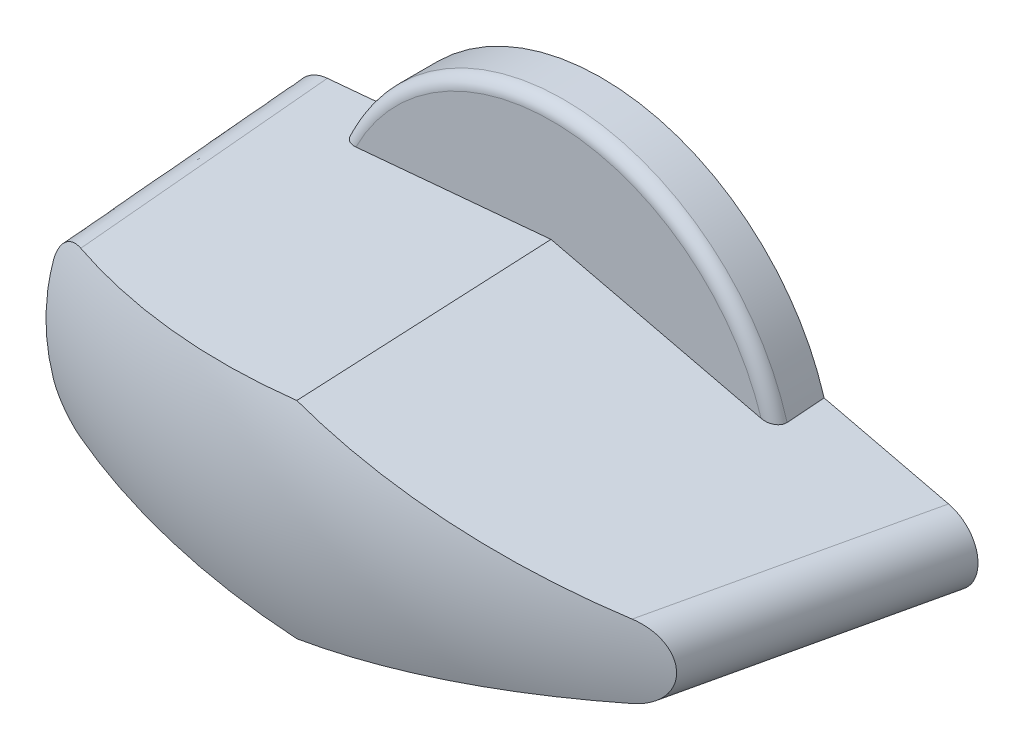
ISO-10303-21;
HEADER;
FILE_DESCRIPTION(('STEP AP214'),'2;1');
FILE_NAME('part.step','',(''),(''),'','','');
FILE_SCHEMA(('AUTOMOTIVE_DESIGN { 1 0 10303 214 1 1 1 1 }'));
ENDSEC;
DATA;
#1=APPLICATION_CONTEXT('core data for automotive mechanical design processes');
#2=APPLICATION_PROTOCOL_DEFINITION('international standard','automotive_design',2000,#1);
#3=PRODUCT_CONTEXT('',#1,'mechanical');
#4=PRODUCT('Part','Part','',(#3));
#5=PRODUCT_RELATED_PRODUCT_CATEGORY('part','',(#4));
#6=PRODUCT_DEFINITION_FORMATION('','',#4);
#7=PRODUCT_DEFINITION_CONTEXT('part definition',#1,'design');
#8=PRODUCT_DEFINITION('design','',#6,#7);
#9=PRODUCT_DEFINITION_SHAPE('','',#8);
#10=(LENGTH_UNIT() NAMED_UNIT(*) SI_UNIT(.MILLI.,.METRE.));
#11=(NAMED_UNIT(*) PLANE_ANGLE_UNIT() SI_UNIT($,.RADIAN.));
#12=(NAMED_UNIT(*) SI_UNIT($,.STERADIAN.) SOLID_ANGLE_UNIT());
#13=UNCERTAINTY_MEASURE_WITH_UNIT(LENGTH_MEASURE(1.E-05),#10,'distance_accuracy_value','');
#14=(GEOMETRIC_REPRESENTATION_CONTEXT(3) GLOBAL_UNCERTAINTY_ASSIGNED_CONTEXT((#13)) GLOBAL_UNIT_ASSIGNED_CONTEXT((#10,
#11,#12)) REPRESENTATION_CONTEXT('',''));
#15=CARTESIAN_POINT('',(0.,0.,0.));
#16=DIRECTION('',(0.,0.,1.));
#17=DIRECTION('',(1.,0.,0.));
#18=AXIS2_PLACEMENT_3D('',#15,#16,#17);
#19=CARTESIAN_POINT('',(-0.0588096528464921,0.,0.));
#20=DIRECTION('',(0.,0.,1.));
#21=DIRECTION('',(-1.,0.,0.));
#22=AXIS2_PLACEMENT_3D('',#19,#20,#21);
#23=PLANE('',#22);
#24=CARTESIAN_POINT('',(0.,0.,0.));
#25=DIRECTION('',(0.,0.,-1.));
#26=DIRECTION('',(1.,0.,0.));
#27=AXIS2_PLACEMENT_3D('',#24,#25,#26);
#28=CIRCLE('',#27,18.5);
#29=CARTESIAN_POINT('',(-16.6788125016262,-8.00419974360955,0.));
#30=VERTEX_POINT('',#29);
#31=CARTESIAN_POINT('',(17.7329510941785,-5.27185408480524,0.));
#32=VERTEX_POINT('',#31);
#33=EDGE_CURVE('E123',#30,#32,#28,.F.);
#34=ORIENTED_EDGE('',*,*,#33,.F.);
#35=DIRECTION('',(0.995974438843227,-0.0896376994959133,0.));
#36=VECTOR('',#35,1.);
#37=CARTESIAN_POINT('',(-23.9541229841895,-7.3494218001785,0.));
#38=LINE('',#37,#36);
#39=CARTESIAN_POINT('',(-21.854947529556,-7.53834759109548,0.));
#40=VERTEX_POINT('',#39);
#41=EDGE_CURVE('E170',#40,#30,#38,.T.);
#42=ORIENTED_EDGE('',*,*,#41,.F.);
#43=CARTESIAN_POINT('',(-22.279737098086,-2.42806845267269,50.5041306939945));
#44=CARTESIAN_POINT('',(-22.0083106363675,-4.86152398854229,50.6089135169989));
#45=CARTESIAN_POINT('',(-19.5701196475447,-5.08647480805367,50.5041306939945));
#46=CARTESIAN_POINT('',(-22.5969775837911,-2.80132132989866,43.7115238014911));
#47=CARTESIAN_POINT('',(-22.2915646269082,-5.19152909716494,43.8529148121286));
#48=CARTESIAN_POINT('',(-19.8922826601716,-5.41490441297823,43.7115238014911));
#49=CARTESIAN_POINT('',(-22.9069347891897,-3.17284472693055,36.9186375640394));
#50=CARTESIAN_POINT('',(-22.5725652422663,-5.52403357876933,37.0532713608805));
#51=CARTESIAN_POINT('',(-20.207881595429,-5.74393948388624,36.9186375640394));
#52=CARTESIAN_POINT('',(-23.514039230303,-3.91288914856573,23.3323986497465));
#53=CARTESIAN_POINT('',(-23.1265800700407,-6.189335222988,23.4620821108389));
#54=CARTESIAN_POINT('',(-20.8273526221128,-6.4030895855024,23.3323986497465));
#55=CARTESIAN_POINT('',(-23.81118649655,-4.2814101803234,16.5390459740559));
#56=CARTESIAN_POINT('',(-23.4000317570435,-6.52255348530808,16.6617853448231));
#57=CARTESIAN_POINT('',(-21.1312247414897,-6.73320461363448,16.5390459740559));
#58=CARTESIAN_POINT('',(-24.3944289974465,-5.01590804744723,2.95193750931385));
#59=CARTESIAN_POINT('',(-23.9395278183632,-7.18921165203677,3.06964904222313));
#60=CARTESIAN_POINT('',(-21.7286448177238,-7.3943850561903,2.95193750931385));
#61=CARTESIAN_POINT('',(-24.6805242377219,-5.38188488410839,-3.84181827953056));
#62=CARTESIAN_POINT('',(-24.2059216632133,-7.52299665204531,-3.7293465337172));
#63=CARTESIAN_POINT('',(-22.0221927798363,-7.72545047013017,-3.84181827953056));
#64=CARTESIAN_POINT('',(-25.2429280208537,-6.11163792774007,-17.4296992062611));
#65=CARTESIAN_POINT('',(-24.7319727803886,-8.19088396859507,-17.321845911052));
#66=CARTESIAN_POINT('',(-22.6000102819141,-8.388435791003,-17.4296992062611));
#67=CARTESIAN_POINT('',(-25.51923654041,-6.47541412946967,-24.2238243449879));
#68=CARTESIAN_POINT('',(-24.9919163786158,-8.52527721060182,-24.1213682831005));
#69=CARTESIAN_POINT('',(-22.8842797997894,-8.72035569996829,-24.2238243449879));
#70=CARTESIAN_POINT('',(-25.7912836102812,-6.83826083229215,-31.0180993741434));
#71=CARTESIAN_POINT('',(-25.2496097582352,-8.86095765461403,-30.9415043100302));
#72=CARTESIAN_POINT('',(-23.1644321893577,-9.05265403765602,-31.0180993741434));
#73=(BOUNDED_SURFACE() B_SPLINE_SURFACE(3,2,((#43,#44,#45),(#46,#47,#48),(#49,#50,#51),(#52,#53,
#54),(#55,#56,#57),(#58,#59,#60),(#61,#62,#63),(#64,#65,#66),(#67,#68,#69),(#70,#71,#72)),
.UNSPECIFIED.,.F.,.F.,.F.) B_SPLINE_SURFACE_WITH_KNOTS((4,2,2,2,4),(3,3),(0.,20.424499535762,
40.8489503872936,61.2733908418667,81.6978799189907),(0.,1.),
.UNSPECIFIED.) GEOMETRIC_REPRESENTATION_ITEM() RATIONAL_B_SPLINE_SURFACE(((1.,0.774432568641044,
1.),(1.,0.779180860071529,1.),(1.,0.783631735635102,1.),(1.,0.792025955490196,1.),(1.,
0.795969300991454,1.),(1.,0.803435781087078,1.),(1.,0.806958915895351,1.),(1.,0.813646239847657,
1.),(1.,0.816810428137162,1.),(1.,0.819825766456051,1.))) REPRESENTATION_ITEM('') SURFACE());
#74=CARTESIAN_POINT('',(-21.854947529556,-7.53834759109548,0.));
#75=CARTESIAN_POINT('',(-21.9388796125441,-7.53080200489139,0.));
#76=CARTESIAN_POINT('',(-22.0224884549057,-7.51970446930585,0.));
#77=CARTESIAN_POINT('',(-22.1884734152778,-7.49051766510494,0.));
#78=CARTESIAN_POINT('',(-22.2708495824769,-7.47242867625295,0.));
#79=CARTESIAN_POINT('',(-22.4337486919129,-7.42938136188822,0.));
#80=CARTESIAN_POINT('',(-22.5142725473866,-7.40442650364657,0.));
#81=CARTESIAN_POINT('',(-22.6729121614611,-7.34783733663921,0.));
#82=CARTESIAN_POINT('',(-22.7510279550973,-7.31620312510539,0.));
#83=CARTESIAN_POINT('',(-22.9810006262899,-7.21154985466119,0.));
#84=CARTESIAN_POINT('',(-23.1285544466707,-7.12876115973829,0.));
#85=CARTESIAN_POINT('',(-23.4075292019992,-6.93962372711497,0.));
#86=CARTESIAN_POINT('',(-23.5389543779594,-6.83328120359,0.));
#87=CARTESIAN_POINT('',(-23.7820048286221,-6.60010558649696,0.));
#88=CARTESIAN_POINT('',(-23.8936435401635,-6.47328651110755,0.));
#89=CARTESIAN_POINT('',(-24.0940459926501,-6.20267784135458,0.));
#90=CARTESIAN_POINT('',(-24.1828109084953,-6.05888911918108,0.));
#91=CARTESIAN_POINT('',(-24.3176884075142,-5.79259716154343,0.));
#92=CARTESIAN_POINT('',(-24.3689077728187,-5.67264709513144,0.));
#93=CARTESIAN_POINT('',(-24.4553231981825,-5.42727304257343,0.));
#94=CARTESIAN_POINT('',(-24.4905386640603,-5.30185588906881,0.));
#95=CARTESIAN_POINT('',(-24.5174130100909,-5.1746228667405,0.));
#96=B_SPLINE_CURVE_WITH_KNOTS('',3,(#74,#75,#76,#77,#78,#79,#80,#81,#82,#83,#84,#85,#86,#87,#88,
#89,#90,#91,#92,#93,#94,#95),.UNSPECIFIED.,.F.,.F.,(4,2,2,2,2,2,2,2,2,2,4),(0.,
0.252730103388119,0.505450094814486,0.758042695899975,1.0106316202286,1.5155898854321,
2.02041508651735,2.52489613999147,3.02935127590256,3.41957439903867,3.80932307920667),.UNSPECIFIED.);
#97=CARTESIAN_POINT('',(-24.5174130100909,-5.1746228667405,0.));
#98=VERTEX_POINT('',#97);
#99=EDGE_CURVE('E361',#40,#98,#96,.T.);
#100=ORIENTED_EDGE('',*,*,#99,.T.);
#101=CARTESIAN_POINT('',(-0.0588096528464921,0.,0.));
#102=DIRECTION('',(0.,0.,1.));
#103=DIRECTION('',(-1.,0.,0.));
#104=AXIS2_PLACEMENT_3D('',#101,#102,#103);
#105=CIRCLE('',#104,25.);
#106=CARTESIAN_POINT('',(-24.5174130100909,5.1746228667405,0.));
#107=VERTEX_POINT('',#106);
#108=EDGE_CURVE('E167',#107,#98,#105,.T.);
#109=ORIENTED_EDGE('',*,*,#108,.F.);
#110=CARTESIAN_POINT('',(-25.7912836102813,6.83826083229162,-31.0180993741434));
#111=CARTESIAN_POINT('',(-25.2496097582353,8.86095765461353,-30.9415043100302));
#112=CARTESIAN_POINT('',(-23.1644321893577,9.05265403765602,-31.0180993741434));
#113=CARTESIAN_POINT('',(-25.51923654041,6.47541412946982,-24.2238243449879));
#114=CARTESIAN_POINT('',(-24.9919163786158,8.52527721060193,-24.1213682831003));
#115=CARTESIAN_POINT('',(-22.8842797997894,8.72035569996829,-24.2238243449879));
#116=CARTESIAN_POINT('',(-25.2429280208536,6.11163792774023,-17.429699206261));
#117=CARTESIAN_POINT('',(-24.7319727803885,8.19088396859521,-17.3218459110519));
#118=CARTESIAN_POINT('',(-22.6000102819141,8.388435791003,-17.429699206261));
#119=CARTESIAN_POINT('',(-24.680524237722,5.38188488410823,-3.84181827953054));
#120=CARTESIAN_POINT('',(-24.2059216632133,7.52299665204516,-3.72934653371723));
#121=CARTESIAN_POINT('',(-22.0221927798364,7.72545047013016,-3.84181827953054));
#122=CARTESIAN_POINT('',(-24.3944289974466,5.01590804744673,2.95193750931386));
#123=CARTESIAN_POINT('',(-23.9395278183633,7.18921165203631,3.06964904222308));
#124=CARTESIAN_POINT('',(-21.7286448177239,7.39438505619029,2.95193750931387));
#125=CARTESIAN_POINT('',(-23.8111864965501,4.28141018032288,16.5390459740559));
#126=CARTESIAN_POINT('',(-23.4000317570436,6.52255348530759,16.6617853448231));
#127=CARTESIAN_POINT('',(-21.1312247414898,6.73320461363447,16.5390459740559));
#128=CARTESIAN_POINT('',(-23.514039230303,3.91288914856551,23.3323986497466));
#129=CARTESIAN_POINT('',(-23.1265800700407,6.1893352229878,23.4620821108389));
#130=CARTESIAN_POINT('',(-20.8273526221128,6.4030895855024,23.3323986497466));
#131=CARTESIAN_POINT('',(-22.9069347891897,3.17284472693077,36.9186375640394));
#132=CARTESIAN_POINT('',(-22.5725652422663,5.52403357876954,37.0532713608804));
#133=CARTESIAN_POINT('',(-20.207881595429,5.74393948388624,36.9186375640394));
#134=CARTESIAN_POINT('',(-22.596977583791,2.801321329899,43.7115238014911));
#135=CARTESIAN_POINT('',(-22.2915646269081,5.19152909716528,43.8529148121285));
#136=CARTESIAN_POINT('',(-19.8922826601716,5.41490441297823,43.7115238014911));
#137=CARTESIAN_POINT('',(-22.279737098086,2.42806845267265,50.5041306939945));
#138=CARTESIAN_POINT('',(-22.0083106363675,4.86152398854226,50.6089135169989));
#139=CARTESIAN_POINT('',(-19.5701196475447,5.08647480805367,50.5041306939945));
#140=(BOUNDED_SURFACE() B_SPLINE_SURFACE(3,2,((#110,#111,#112),(#113,#114,#115),(#116,#117,
#118),(#119,#120,#121),(#122,#123,#124),(#125,#126,#127),(#128,#129,#130),(#131,#132,#133),
(#134,#135,#136),(#137,#138,#139)),.UNSPECIFIED.,.F.,.F.,.F.) B_SPLINE_SURFACE_WITH_KNOTS((4,2,
2,2,4),(3,3),(0.,20.424489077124,40.8489295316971,61.2733803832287,81.6978799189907),(0.,1.),
.UNSPECIFIED.) GEOMETRIC_REPRESENTATION_ITEM() RATIONAL_B_SPLINE_SURFACE(((1.,0.819825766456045,
1.),(1.,0.816810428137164,1.),(1.,0.813646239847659,1.),(1.,0.806958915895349,1.),(1.,
0.803435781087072,1.),(1.,0.795969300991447,1.),(1.,0.792025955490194,1.),(1.,0.783631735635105,
1.),(1.,0.779180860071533,1.),(1.,0.774432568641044,1.))) REPRESENTATION_ITEM('') SURFACE());
#141=CARTESIAN_POINT('',(-24.5174130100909,5.1746228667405,0.));
#142=CARTESIAN_POINT('',(-24.4999802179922,5.25707083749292,0.));
#143=CARTESIAN_POINT('',(-24.4790575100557,5.33877673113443,0.));
#144=CARTESIAN_POINT('',(-24.4304146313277,5.50013586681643,0.));
#145=CARTESIAN_POINT('',(-24.4026947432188,5.57978919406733,0.));
#146=CARTESIAN_POINT('',(-24.3406540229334,5.7364421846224,0.));
#147=CARTESIAN_POINT('',(-24.3063365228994,5.81344316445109,0.));
#148=CARTESIAN_POINT('',(-24.2313532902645,5.96426224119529,0.));
#149=CARTESIAN_POINT('',(-24.1906876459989,6.03808038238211,0.));
#150=CARTESIAN_POINT('',(-24.0595284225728,6.25403659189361,0.));
#151=CARTESIAN_POINT('',(-23.9598451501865,6.39074545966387,0.));
#152=CARTESIAN_POINT('',(-23.738993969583,6.6453522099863,0.));
#153=CARTESIAN_POINT('',(-23.6178317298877,6.76325504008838,0.));
#154=CARTESIAN_POINT('',(-23.3575064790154,6.97697250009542,0.));
#155=CARTESIAN_POINT('',(-23.2183557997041,7.07280213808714,0.));
#156=CARTESIAN_POINT('',(-22.9259138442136,7.23973914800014,0.));
#157=CARTESIAN_POINT('',(-22.7726232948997,7.31084778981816,0.));
#158=CARTESIAN_POINT('',(-22.4922291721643,7.41323105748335,0.));
#159=CARTESIAN_POINT('',(-22.367056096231,7.44987964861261,0.));
#160=CARTESIAN_POINT('',(-22.1131729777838,7.50661958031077,0.));
#161=CARTESIAN_POINT('',(-21.984467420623,7.52673099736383,0.));
#162=CARTESIAN_POINT('',(-21.854947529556,7.53834759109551,0.));
#163=B_SPLINE_CURVE_WITH_KNOTS('',3,(#141,#142,#143,#144,#145,#146,#147,#148,#149,#150,#151,
#152,#153,#154,#155,#156,#157,#158,#159,#160,#161,#162),.UNSPECIFIED.,.F.,.F.,(4,2,2,2,2,2,2,2,
2,2,4),(0.,0.252730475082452,0.50545044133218,0.758043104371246,1.01063225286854,
1.51559059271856,2.02041586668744,2.52489687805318,3.02935197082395,3.41957484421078,
3.80932327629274),.UNSPECIFIED.);
#164=CARTESIAN_POINT('',(-21.854947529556,7.53834759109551,0.));
#165=VERTEX_POINT('',#164);
#166=EDGE_CURVE('E360',#107,#165,#163,.T.);
#167=ORIENTED_EDGE('',*,*,#166,.T.);
#168=DIRECTION('',(0.995974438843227,0.0896376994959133,0.));
#169=VECTOR('',#168,1.);
#170=CARTESIAN_POINT('',(-23.9541229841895,7.3494218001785,0.));
#171=LINE('',#170,#169);
#172=CARTESIAN_POINT('',(-16.6788125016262,8.00419974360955,0.));
#173=VERTEX_POINT('',#172);
#174=EDGE_CURVE('E154',#165,#173,#171,.T.);
#175=ORIENTED_EDGE('',*,*,#174,.T.);
#176=CARTESIAN_POINT('',(17.732951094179,5.27185408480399,0.));
#177=VERTEX_POINT('',#176);
#178=EDGE_CURVE('E134',#177,#173,#28,.F.);
#179=ORIENTED_EDGE('',*,*,#178,.F.);
#180=DIRECTION('',(0.972904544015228,-0.231207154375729,0.));
#181=VECTOR('',#180,1.);
#182=CARTESIAN_POINT('',(-0.0588096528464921,9.5,0.));
#183=LINE('',#182,#181);
#184=CARTESIAN_POINT('',(27.6516435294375,2.91471363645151,0.));
#185=VERTEX_POINT('',#184);
#186=EDGE_CURVE('E151',#177,#185,#183,.T.);
#187=ORIENTED_EDGE('',*,*,#186,.T.);
#188=CARTESIAN_POINT('',(26.923383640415,0.,0.));
#189=DIRECTION('',(0.,0.,1.));
#190=DIRECTION('',(1.,0.,0.));
#191=AXIS2_PLACEMENT_3D('',#188,#189,#190);
#192=ELLIPSE('',#191,3.07610379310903,3.);
#193=CARTESIAN_POINT('',(27.6516435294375,-2.91471363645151,0.));
#194=VERTEX_POINT('',#193);
#195=EDGE_CURVE('E149',#185,#194,#192,.F.);
#196=ORIENTED_EDGE('',*,*,#195,.T.);
#197=DIRECTION('',(0.972904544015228,0.231207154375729,0.));
#198=VECTOR('',#197,1.);
#199=CARTESIAN_POINT('',(-0.0588096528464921,-9.5,0.));
#200=LINE('',#199,#198);
#201=EDGE_CURVE('E140',#32,#194,#200,.T.);
#202=ORIENTED_EDGE('',*,*,#201,.F.);
#203=EDGE_LOOP('',(#34,#42,#100,#109,#167,#175,#179,#187,#196,#202));
#204=FACE_BOUND('',#203,.T.);
#205=CARTESIAN_POINT('',(0.,0.,0.));
#206=DIRECTION('',(0.,0.,1.));
#207=DIRECTION('',(-1.,0.,0.));
#208=AXIS2_PLACEMENT_3D('',#205,#206,#207);
#209=CIRCLE('',#208,11.);
#210=CARTESIAN_POINT('',(-11.,0.,0.));
#211=VERTEX_POINT('',#210);
#212=EDGE_CURVE('E9',#211,#211,#209,.F.);
#213=ORIENTED_EDGE('',*,*,#212,.F.);
#214=EDGE_LOOP('',(#213));
#215=FACE_BOUND('',#214,.T.);
#216=ADVANCED_FACE('F14',(#204,#215),#23,.F.);
#217=CARTESIAN_POINT('',(0.,0.,-0.500030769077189));
#218=DIRECTION('',(0.,0.,-1.));
#219=DIRECTION('',(0.,-1.,0.));
#220=AXIS2_PLACEMENT_3D('',#217,#218,#219);
#221=CYLINDRICAL_SURFACE('',#220,18.5);
#222=CARTESIAN_POINT('',(0.,0.,176.099733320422));
#223=DIRECTION('',(0.230890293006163,0.971571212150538,0.052335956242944));
#224=DIRECTION('',(0.0121004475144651,0.050917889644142,-0.998629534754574));
#225=AXIS2_PLACEMENT_3D('',#222,#223,#224);
#226=ELLIPSE('',#225,353.485468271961,18.5);
#227=CARTESIAN_POINT('',(17.7836533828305,5.0982028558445,3.));
#228=VERTEX_POINT('',#227);
#229=EDGE_CURVE('E145',#228,#177,#226,.T.);
#230=ORIENTED_EDGE('',*,*,#229,.T.);
#231=ORIENTED_EDGE('',*,*,#178,.T.);
#232=CARTESIAN_POINT('',(0.,0.,180.641669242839));
#233=DIRECTION('',(-0.0895148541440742,0.994609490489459,0.052335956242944));
#234=DIRECTION('',(-0.00469127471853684,0.0521252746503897,-0.998629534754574));
#235=AXIS2_PLACEMENT_3D('',#232,#233,#234);
#236=ELLIPSE('',#235,353.48546827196,18.5);
#237=CARTESIAN_POINT('',(-16.7569458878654,7.8393089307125,3.));
#238=VERTEX_POINT('',#237);
#239=EDGE_CURVE('E400',#173,#238,#236,.T.);
#240=ORIENTED_EDGE('',*,*,#239,.T.);
#241=CARTESIAN_POINT('',(0.,0.,3.));
#242=DIRECTION('',(0.,0.,-1.));
#243=DIRECTION('',(0.,-1.,0.));
#244=AXIS2_PLACEMENT_3D('',#241,#242,#243);
#245=CIRCLE('',#244,18.5);
#246=EDGE_CURVE('E398',#238,#228,#245,.T.);
#247=ORIENTED_EDGE('',*,*,#246,.T.);
#248=EDGE_LOOP('',(#230,#231,#240,#247));
#249=FACE_BOUND('',#248,.T.);
#250=ADVANCED_FACE('F270',(#249),#221,.T.);
#251=CARTESIAN_POINT('',(0.,0.,180.641669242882));
#252=DIRECTION('',(-0.0895148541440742,-0.994609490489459,0.052335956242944));
#253=DIRECTION('',(-0.00469127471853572,-0.0521252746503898,-0.998629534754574));
#254=AXIS2_PLACEMENT_3D('',#251,#252,#253);
#255=ELLIPSE('',#254,353.485468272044,18.5);
#256=CARTESIAN_POINT('',(-16.7569458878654,-7.8393089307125,3.00000000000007));
#257=VERTEX_POINT('',#256);
#258=EDGE_CURVE('E130',#30,#257,#255,.F.);
#259=ORIENTED_EDGE('',*,*,#258,.F.);
#260=ORIENTED_EDGE('',*,*,#33,.T.);
#261=CARTESIAN_POINT('',(0.,0.,176.099733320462));
#262=DIRECTION('',(0.230890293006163,-0.971571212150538,0.052335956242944));
#263=DIRECTION('',(0.0121004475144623,-0.0509178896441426,-0.998629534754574));
#264=AXIS2_PLACEMENT_3D('',#261,#262,#263);
#265=ELLIPSE('',#264,353.485468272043,18.5);
#266=CARTESIAN_POINT('',(17.7836533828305,-5.0982028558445,3.00000000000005));
#267=VERTEX_POINT('',#266);
#268=EDGE_CURVE('E127',#267,#32,#265,.F.);
#269=ORIENTED_EDGE('',*,*,#268,.F.);
#270=EDGE_CURVE('E417',#267,#257,#245,.T.);
#271=ORIENTED_EDGE('',*,*,#270,.T.);
#272=EDGE_LOOP('',(#259,#260,#269,#271));
#273=FACE_BOUND('',#272,.T.);
#274=ADVANCED_FACE('F125',(#273),#221,.T.);
#275=CARTESIAN_POINT('',(-0.0213958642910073,0.,2.90659003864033));
#276=DIRECTION('',(0.,0.,-1.));
#277=DIRECTION('',(0.,-1.,0.));
#278=AXIS2_PLACEMENT_3D('',#275,#276,#277);
#279=CONICAL_SURFACE('',#278,7.5,0.0872664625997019);
#280=CARTESIAN_POINT('',(-0.0213958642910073,0.,2.90659003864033));
#281=DIRECTION('',(0.,0.,-1.));
#282=DIRECTION('',(0.,-1.,0.));
#283=AXIS2_PLACEMENT_3D('',#280,#281,#282);
#284=CIRCLE('',#283,7.5);
#285=CARTESIAN_POINT('',(-0.0213958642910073,-7.5,2.90659003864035));
#286=VERTEX_POINT('',#285);
#287=EDGE_CURVE('E423',#286,#286,#284,.T.);
#288=ORIENTED_EDGE('',*,*,#287,.F.);
#289=EDGE_LOOP('',(#288));
#290=FACE_BOUND('',#289,.T.);
#291=CARTESIAN_POINT('',(-0.0213958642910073,0.,0.));
#292=DIRECTION('',(0.,0.,-1.));
#293=DIRECTION('',(1.,0.,0.));
#294=AXIS2_PLACEMENT_3D('',#291,#292,#293);
#295=CIRCLE('',#294,7.75429367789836);
#296=CARTESIAN_POINT('',(7.73289781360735,0.,0.));
#297=VERTEX_POINT('',#296);
#298=EDGE_CURVE('E429',#297,#297,#295,.T.);
#299=ORIENTED_EDGE('',*,*,#298,.T.);
#300=EDGE_LOOP('',(#299));
#301=FACE_BOUND('',#300,.T.);
#302=ADVANCED_FACE('F391',(#290,#301),#279,.F.);
#303=CARTESIAN_POINT('',(-0.0588096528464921,0.,0.));
#304=DIRECTION('',(0.,0.,-1.));
#305=DIRECTION('',(-1.,0.,0.));
#306=AXIS2_PLACEMENT_3D('',#303,#304,#305);
#307=CONICAL_SURFACE('',#306,25.,0.05235987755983);
#308=CARTESIAN_POINT('',(-22.922344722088,-7.23183926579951,19.4626261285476));
#309=CARTESIAN_POINT('',(-23.0138099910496,-6.93054830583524,19.5325305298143));
#310=CARTESIAN_POINT('',(-23.099808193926,-6.62663985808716,19.5983495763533));
#311=CARTESIAN_POINT('',(-23.2605464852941,-6.0141324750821,19.7215088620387));
#312=CARTESIAN_POINT('',(-23.3352854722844,-5.70553308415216,19.7788482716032));
#313=CARTESIAN_POINT('',(-23.4731922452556,-5.08411716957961,19.8847485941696));
#314=CARTESIAN_POINT('',(-23.5363551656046,-4.77129893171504,19.9333058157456));
#315=CARTESIAN_POINT('',(-23.6507819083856,-4.14226554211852,20.0213400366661));
#316=CARTESIAN_POINT('',(-23.7020462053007,-3.82605052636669,20.060817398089));
#317=CARTESIAN_POINT('',(-23.8345431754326,-2.89484816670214,20.1629072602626));
#318=CARTESIAN_POINT('',(-23.8992029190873,-2.2759620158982,20.2128106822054));
#319=CARTESIAN_POINT('',(-23.9819346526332,-1.0335142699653,20.2766785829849));
#320=CARTESIAN_POINT('',(-24.0000225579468,-0.409954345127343,20.2906553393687));
#321=CARTESIAN_POINT('',(-23.9896458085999,0.802183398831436,20.2826407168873));
#322=CARTESIAN_POINT('',(-23.9636883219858,1.3907978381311,20.2625864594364));
#323=CARTESIAN_POINT('',(-23.8703489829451,2.56296212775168,20.1905462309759));
#324=CARTESIAN_POINT('',(-23.8029581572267,3.14651085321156,20.1385533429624));
#325=CARTESIAN_POINT('',(-23.6702215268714,4.0239886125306,20.0363106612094));
#326=CARTESIAN_POINT('',(-23.6196269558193,4.32159262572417,19.9973617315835));
#327=CARTESIAN_POINT('',(-23.5078976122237,4.9136769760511,19.9114280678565));
#328=CARTESIAN_POINT('',(-23.4467625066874,5.20815721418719,19.8644430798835));
#329=CARTESIAN_POINT('',(-23.3142207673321,5.79332380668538,19.7626865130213));
#330=CARTESIAN_POINT('',(-23.2428174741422,6.0840113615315,19.7079174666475));
#331=CARTESIAN_POINT('',(-23.0900111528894,6.66118767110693,19.5908515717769));
#332=CARTESIAN_POINT('',(-23.0086089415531,6.94767676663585,19.5285553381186));
#333=CARTESIAN_POINT('',(-22.922344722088,7.23183926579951,19.4626261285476));
#334=B_SPLINE_CURVE_WITH_KNOTS('',3,(#308,#309,#310,#311,#312,#313,#314,#315,#316,#317,#318,
#319,#320,#321,#322,#323,#324,#325,#326,#327,#328,#329,#330,#331,#332,#333),.UNSPECIFIED.,.F.,
.F.,(4,2,2,2,2,2,2,2,2,2,2,2,4),(0.,0.967534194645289,1.93516298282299,2.90319755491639,
3.87119351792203,5.74097872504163,7.61012486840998,9.37640534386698,11.1430684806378,
12.0559448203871,12.9688500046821,13.8814588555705,14.7939932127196),.UNSPECIFIED.);
#335=CARTESIAN_POINT('',(-23.6571447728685,-4.091885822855,20.0262505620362));
#336=VERTEX_POINT('',#335);
#337=CARTESIAN_POINT('',(-23.65714477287,4.09188582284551,20.0262505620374));
#338=VERTEX_POINT('',#337);
#339=EDGE_CURVE('E223',#336,#338,#334,.T.);
#340=ORIENTED_EDGE('',*,*,#339,.T.);
#341=CARTESIAN_POINT('',(-22.279737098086,2.42806845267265,50.5041306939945));
#342=CARTESIAN_POINT('',(-22.596977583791,2.801321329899,43.7115238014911));
#343=CARTESIAN_POINT('',(-22.9069347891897,3.17284472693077,36.9186375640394));
#344=CARTESIAN_POINT('',(-23.514039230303,3.91288914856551,23.3323986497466));
#345=CARTESIAN_POINT('',(-23.8111864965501,4.28141018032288,16.5390459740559));
#346=CARTESIAN_POINT('',(-24.3944289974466,5.01590804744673,2.95193750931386));
#347=CARTESIAN_POINT('',(-24.680524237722,5.38188488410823,-3.84181827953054));
#348=CARTESIAN_POINT('',(-25.2429280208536,6.11163792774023,-17.429699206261));
#349=CARTESIAN_POINT('',(-25.51923654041,6.47541412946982,-24.2238243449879));
#350=CARTESIAN_POINT('',(-25.7912836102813,6.83826083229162,-31.0180993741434));
#351=B_SPLINE_CURVE_WITH_KNOTS('',3,(#341,#342,#343,#344,#345,#346,#347,#348,#349,#350),
.UNSPECIFIED.,.F.,.F.,(4,2,2,2,4),(0.,20.424499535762,40.8489503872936,61.2733908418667,
81.6978799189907),.UNSPECIFIED.);
#352=EDGE_CURVE('E357',#338,#107,#351,.T.);
#353=ORIENTED_EDGE('',*,*,#352,.T.);
#354=ORIENTED_EDGE('',*,*,#108,.T.);
#355=CARTESIAN_POINT('',(-25.7912836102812,-6.83826083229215,-31.0180993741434));
#356=CARTESIAN_POINT('',(-25.51923654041,-6.47541412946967,-24.2238243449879));
#357=CARTESIAN_POINT('',(-25.2429280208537,-6.11163792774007,-17.4296992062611));
#358=CARTESIAN_POINT('',(-24.6805242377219,-5.38188488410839,-3.84181827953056));
#359=CARTESIAN_POINT('',(-24.3944289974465,-5.01590804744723,2.95193750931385));
#360=CARTESIAN_POINT('',(-23.81118649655,-4.2814101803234,16.5390459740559));
#361=CARTESIAN_POINT('',(-23.514039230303,-3.91288914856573,23.3323986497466));
#362=CARTESIAN_POINT('',(-22.9069347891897,-3.17284472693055,36.9186375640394));
#363=CARTESIAN_POINT('',(-22.5969775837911,-2.80132132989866,43.7115238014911));
#364=CARTESIAN_POINT('',(-22.279737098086,-2.42806845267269,50.5041306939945));
#365=B_SPLINE_CURVE_WITH_KNOTS('',3,(#355,#356,#357,#358,#359,#360,#361,#362,#363,#364),
.UNSPECIFIED.,.F.,.F.,(4,2,2,2,4),(0.,20.424489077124,40.8489295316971,61.2733803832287,
81.6978799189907),.UNSPECIFIED.);
#366=EDGE_CURVE('E191',#98,#336,#365,.T.);
#367=ORIENTED_EDGE('',*,*,#366,.T.);
#368=EDGE_LOOP('',(#340,#353,#354,#367));
#369=FACE_BOUND('',#368,.T.);
#370=ADVANCED_FACE('F277',(#369),#307,.T.);
#371=CARTESIAN_POINT('',(-0.0588096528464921,-9.5,0.));
#372=DIRECTION('',(0.230890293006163,-0.971571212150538,0.052335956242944));
#373=DIRECTION('',(0.972904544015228,0.231207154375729,0.));
#374=AXIS2_PLACEMENT_3D('',#371,#372,#373);
#375=PLANE('',#374);
#376=CARTESIAN_POINT('',(15.508272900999,-5.6389493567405,2.9998));
#377=CARTESIAN_POINT('',(15.5100526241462,-5.6371266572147,3.02578522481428));
#378=CARTESIAN_POINT('',(15.5130119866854,-5.63502994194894,3.05165310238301));
#379=CARTESIAN_POINT('',(15.5212065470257,-5.6303187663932,3.10296004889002));
#380=CARTESIAN_POINT('',(15.5264401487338,-5.62770466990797,3.12839940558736));
#381=CARTESIAN_POINT('',(15.545346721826,-5.61916648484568,3.20349329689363));
#382=CARTESIAN_POINT('',(15.5622523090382,-5.61252066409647,3.25228484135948));
#383=CARTESIAN_POINT('',(15.6036171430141,-5.59763852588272,3.3460696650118));
#384=CARTESIAN_POINT('',(15.6280574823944,-5.58940620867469,3.39107209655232));
#385=CARTESIAN_POINT('',(15.6833908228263,-5.57164391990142,3.47669959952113));
#386=CARTESIAN_POINT('',(15.7142935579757,-5.56211199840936,3.51731792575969));
#387=CARTESIAN_POINT('',(15.7846376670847,-5.54108865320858,3.59726114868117));
#388=CARTESIAN_POINT('',(15.8246141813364,-5.52949695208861,3.63608673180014));
#389=CARTESIAN_POINT('',(15.909611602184,-5.50545621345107,3.70739927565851));
#390=CARTESIAN_POINT('',(15.9546338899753,-5.49300694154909,3.73988449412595));
#391=CARTESIAN_POINT('',(16.0563835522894,-5.46541800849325,3.80316037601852));
#392=CARTESIAN_POINT('',(16.1138139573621,-5.4501745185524,3.83277697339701));
#393=CARTESIAN_POINT('',(16.2324234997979,-5.41928696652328,3.8829081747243));
#394=CARTESIAN_POINT('',(16.2936050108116,-5.40364265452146,3.90341694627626));
#395=CARTESIAN_POINT('',(16.4261288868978,-5.37033330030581,3.93712098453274));
#396=CARTESIAN_POINT('',(16.4977858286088,-5.35265995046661,3.94908265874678));
#397=CARTESIAN_POINT('',(16.6422107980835,-5.31769928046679,3.96093793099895));
#398=CARTESIAN_POINT('',(16.7149792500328,-5.30041211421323,3.96082680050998));
#399=CARTESIAN_POINT('',(16.8621216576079,-5.26613662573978,3.94797376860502));
#400=CARTESIAN_POINT('',(16.9364666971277,-5.24917817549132,3.93480488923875));
#401=CARTESIAN_POINT('',(17.0818097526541,-5.21679094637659,3.89483616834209));
#402=CARTESIAN_POINT('',(17.1528082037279,-5.20136196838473,3.86803810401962));
#403=CARTESIAN_POINT('',(17.2834247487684,-5.17381156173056,3.80324688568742));
#404=CARTESIAN_POINT('',(17.3434970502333,-5.16152879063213,3.76624508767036));
#405=CARTESIAN_POINT('',(17.45548281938,-5.13951480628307,3.68086834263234));
#406=CARTESIAN_POINT('',(17.5074078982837,-5.12977994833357,3.63250983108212));
#407=CARTESIAN_POINT('',(17.5933668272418,-5.11469282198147,3.53336452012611));
#408=CARTESIAN_POINT('',(17.628903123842,-5.10890978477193,3.48394623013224));
#409=CARTESIAN_POINT('',(17.6899234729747,-5.10005866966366,3.37905624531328));
#410=CARTESIAN_POINT('',(17.7154239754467,-5.09698613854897,3.32359464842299));
#411=CARTESIAN_POINT('',(17.7498470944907,-5.09420608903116,3.22333952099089));
#412=CARTESIAN_POINT('',(17.7613385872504,-5.09384044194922,3.17943047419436));
#413=CARTESIAN_POINT('',(17.7776231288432,-5.09477080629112,3.09031663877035));
#414=CARTESIAN_POINT('',(17.782402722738,-5.09607014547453,3.04510943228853));
#415=CARTESIAN_POINT('',(17.7836591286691,-5.098212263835,2.9998));
#416=B_SPLINE_CURVE_WITH_KNOTS('',3,(#376,#377,#378,#379,#380,#381,#382,#383,#384,#385,#386,
#387,#388,#389,#390,#391,#392,#393,#394,#395,#396,#397,#398,#399,#400,#401,#402,#403,#404,#405,
#406,#407,#408,#409,#410,#411,#412,#413,#414,#415),.UNSPECIFIED.,.F.,.F.,(4,2,2,2,2,2,2,2,2,2,2,
2,2,2,2,2,2,2,2,4),(0.,0.0782697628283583,0.156484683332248,0.311840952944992,0.466810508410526,
0.62201519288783,0.792133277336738,0.962298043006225,1.16067751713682,1.35918384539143,
1.58248678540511,1.80587718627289,2.03682145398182,2.26773561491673,2.48131626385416,
2.69458970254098,2.87694277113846,3.05899568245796,3.19464111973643,3.33055809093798),.UNSPECIFIED.);
#417=CARTESIAN_POINT('',(16.6749466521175,-5.31000509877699,3.95935306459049));
#418=VERTEX_POINT('',#417);
#419=EDGE_CURVE('E143',#418,#267,#416,.T.);
#420=ORIENTED_EDGE('',*,*,#419,.T.);
#421=ORIENTED_EDGE('',*,*,#268,.T.);
#422=ORIENTED_EDGE('',*,*,#201,.T.);
#423=DIRECTION('',(0.221062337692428,0.,-0.975259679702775));
#424=VECTOR('',#423,1.);
#425=CARTESIAN_POINT('',(26.2974736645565,-2.91471363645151,5.97418484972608));
#426=LINE('',#425,#424);
#427=CARTESIAN_POINT('',(22.9917270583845,-2.91471363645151,20.5581316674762));
#428=VERTEX_POINT('',#427);
#429=EDGE_CURVE('E182',#194,#428,#426,.F.);
#430=ORIENTED_EDGE('',*,*,#429,.T.);
#431=CARTESIAN_POINT('',(37.1886797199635,0.000200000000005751,12.0383220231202));
#432=CARTESIAN_POINT('',(36.7184842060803,-0.0904125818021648,12.4305381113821));
#433=CARTESIAN_POINT('',(36.2418490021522,-0.183000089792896,12.8145013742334));
#434=CARTESIAN_POINT('',(35.2762611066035,-0.372008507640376,13.5656051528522));
#435=CARTESIAN_POINT('',(34.7873087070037,-0.468429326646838,13.9327460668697));
#436=CARTESIAN_POINT('',(33.3029237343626,-0.76324603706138,15.0083861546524));
#437=CARTESIAN_POINT('',(32.2898309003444,-0.96722171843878,15.6912131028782));
#438=CARTESIAN_POINT('',(30.2208495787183,-1.38917861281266,16.9856679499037));
#439=CARTESIAN_POINT('',(29.1649296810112,-1.60717017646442,17.5972422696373));
#440=CARTESIAN_POINT('',(27.5533411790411,-1.94376523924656,18.4584870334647));
#441=CARTESIAN_POINT('',(27.0115134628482,-2.05756774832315,18.7362218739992));
#442=CARTESIAN_POINT('',(25.9190783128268,-2.28828084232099,19.2727262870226));
#443=CARTESIAN_POINT('',(25.3684693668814,-2.4051919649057,19.5314925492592));
#444=CARTESIAN_POINT('',(23.7043127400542,-2.76041464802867,20.2788463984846));
#445=CARTESIAN_POINT('',(22.5785401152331,-3.00319362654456,20.7384330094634));
#446=CARTESIAN_POINT('',(20.2998462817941,-3.49951662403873,21.5775339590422));
#447=CARTESIAN_POINT('',(19.1469252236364,-3.75306058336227,21.9570487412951));
#448=CARTESIAN_POINT('',(17.4017635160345,-4.14046410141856,22.4643632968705));
#449=CARTESIAN_POINT('',(16.8175806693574,-4.27074195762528,22.6231056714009));
#450=CARTESIAN_POINT('',(15.6445710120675,-4.53352520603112,22.9197259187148));
#451=CARTESIAN_POINT('',(15.0557451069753,-4.66603016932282,23.0576077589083));
#452=CARTESIAN_POINT('',(13.2831748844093,-5.06669809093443,23.4395982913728));
#453=CARTESIAN_POINT('',(12.0931430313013,-5.33805737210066,23.6521087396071));
#454=CARTESIAN_POINT('',(9.98215917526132,-5.82361392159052,23.9511940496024));
#455=CARTESIAN_POINT('',(9.06332790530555,-6.03634698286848,24.0555946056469));
#456=CARTESIAN_POINT('',(7.2219719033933,-6.46546204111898,24.2129508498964));
#457=CARTESIAN_POINT('',(6.29944685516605,-6.68184435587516,24.2659020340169));
#458=CARTESIAN_POINT('',(4.45330977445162,-7.11768004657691,24.3195882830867));
#459=CARTESIAN_POINT('',(3.52969750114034,-7.33713431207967,24.3203078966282));
#460=CARTESIAN_POINT('',(1.68453102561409,-7.77840656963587,24.2687870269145));
#461=CARTESIAN_POINT('',(0.762976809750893,-8.00022454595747,24.2165468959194));
#462=CARTESIAN_POINT('',(-0.156118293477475,-8.22290351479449,24.1374743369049));
#463=B_SPLINE_CURVE_WITH_KNOTS('',3,(#431,#432,#433,#434,#435,#436,#437,#438,#439,#440,#441,
#442,#443,#444,#445,#446,#447,#448,#449,#450,#451,#452,#453,#454,#455,#456,#457,#458,#459,#460,
#461,#462),.UNSPECIFIED.,.F.,.F.,(4,2,2,2,2,2,2,2,2,2,2,2,2,2,2,4),(0.,1.85673326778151,
3.71342255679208,7.42627918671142,11.1419099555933,12.9998152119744,14.8580439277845,
18.5748632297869,22.291661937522,24.1490091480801,26.0060026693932,29.7193680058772,
32.564786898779,35.410454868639,38.256964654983,41.1034555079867),.UNSPECIFIED.);
#464=CARTESIAN_POINT('',(-0.150731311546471,-8.22159836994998,24.1379374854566));
#465=VERTEX_POINT('',#464);
#466=EDGE_CURVE('E152',#428,#465,#463,.T.);
#467=ORIENTED_EDGE('',*,*,#466,.T.);
#468=DIRECTION('',(0.00380282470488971,-0.0528878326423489,-0.998593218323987));
#469=VECTOR('',#468,1.);
#470=CARTESIAN_POINT('',(-0.0588096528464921,-9.5,0.));
#471=LINE('',#470,#469);
#472=CARTESIAN_POINT('',(-0.0738875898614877,-9.29030340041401,3.95935306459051));
#473=VERTEX_POINT('',#472);
#474=EDGE_CURVE('E172',#465,#473,#471,.T.);
#475=ORIENTED_EDGE('',*,*,#474,.T.);
#476=DIRECTION('',(0.972904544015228,0.231207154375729,0.));
#477=VECTOR('',#476,1.);
#478=CARTESIAN_POINT('',(-0.106785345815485,-9.298121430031,3.95935306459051));
#479=LINE('',#478,#477);
#480=EDGE_CURVE('E144',#418,#473,#479,.F.);
#481=ORIENTED_EDGE('',*,*,#480,.F.);
#482=EDGE_LOOP('',(#420,#421,#422,#430,#467,#475,#481));
#483=FACE_BOUND('',#482,.T.);
#484=ADVANCED_FACE('F139',(#483),#375,.T.);
#485=CARTESIAN_POINT('',(-0.0588096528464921,9.5,0.));
#486=DIRECTION('',(0.230890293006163,0.971571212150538,0.052335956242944));
#487=DIRECTION('',(-0.972904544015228,0.231207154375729,0.));
#488=AXIS2_PLACEMENT_3D('',#485,#486,#487);
#489=PLANE('',#488);
#490=ORIENTED_EDGE('',*,*,#229,.F.);
#491=CARTESIAN_POINT('',(15.508272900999,5.6389493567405,2.9998));
#492=CARTESIAN_POINT('',(15.5100526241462,5.63712665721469,3.02578522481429));
#493=CARTESIAN_POINT('',(15.5130119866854,5.63502994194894,3.05165310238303));
#494=CARTESIAN_POINT('',(15.5212065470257,5.6303187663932,3.10296004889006));
#495=CARTESIAN_POINT('',(15.5264401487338,5.62770466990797,3.12839940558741));
#496=CARTESIAN_POINT('',(15.545346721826,5.61916648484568,3.20349329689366));
#497=CARTESIAN_POINT('',(15.5622523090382,5.61252066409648,3.25228484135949));
#498=CARTESIAN_POINT('',(15.6036171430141,5.59763852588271,3.34606966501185));
#499=CARTESIAN_POINT('',(15.6280574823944,5.58940620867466,3.39107209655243));
#500=CARTESIAN_POINT('',(15.6833908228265,5.5716439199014,3.4766995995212));
#501=CARTESIAN_POINT('',(15.7142935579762,5.56211199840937,3.51731792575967));
#502=CARTESIAN_POINT('',(15.7846376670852,5.54108865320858,3.59726114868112));
#503=CARTESIAN_POINT('',(15.8246141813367,5.52949695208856,3.63608673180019));
#504=CARTESIAN_POINT('',(15.9096116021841,5.50545621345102,3.7073992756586));
#505=CARTESIAN_POINT('',(15.9546338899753,5.4930069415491,3.73988449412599));
#506=CARTESIAN_POINT('',(16.0563835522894,5.46541800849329,3.80316037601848));
#507=CARTESIAN_POINT('',(16.1138139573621,5.45017451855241,3.83277697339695));
#508=CARTESIAN_POINT('',(16.2324234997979,5.41928696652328,3.88290817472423));
#509=CARTESIAN_POINT('',(16.2936050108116,5.40364265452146,3.90341694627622));
#510=CARTESIAN_POINT('',(16.4261288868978,5.37033330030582,3.93712098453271));
#511=CARTESIAN_POINT('',(16.4977858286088,5.35265995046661,3.94908265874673));
#512=CARTESIAN_POINT('',(16.6422107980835,5.31769928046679,3.96093793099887));
#513=CARTESIAN_POINT('',(16.7149792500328,5.30041211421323,3.96082680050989));
#514=CARTESIAN_POINT('',(16.8621216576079,5.26613662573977,3.94797376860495));
#515=CARTESIAN_POINT('',(16.9364666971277,5.24917817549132,3.9348048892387));
#516=CARTESIAN_POINT('',(17.0818097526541,5.21679094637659,3.89483616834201));
#517=CARTESIAN_POINT('',(17.1528082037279,5.20136196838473,3.86803810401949));
#518=CARTESIAN_POINT('',(17.2834247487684,5.17381156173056,3.80324688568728));
#519=CARTESIAN_POINT('',(17.3434970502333,5.16152879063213,3.76624508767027));
#520=CARTESIAN_POINT('',(17.4554828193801,5.13951480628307,3.68086834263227));
#521=CARTESIAN_POINT('',(17.5074078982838,5.12977994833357,3.63250983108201));
#522=CARTESIAN_POINT('',(17.5933668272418,5.11469282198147,3.53336452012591));
#523=CARTESIAN_POINT('',(17.6289031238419,5.10890978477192,3.48394623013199));
#524=CARTESIAN_POINT('',(17.6899234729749,5.10005866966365,3.37905624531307));
#525=CARTESIAN_POINT('',(17.7154239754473,5.09698613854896,3.32359464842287));
#526=CARTESIAN_POINT('',(17.7498470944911,5.09420608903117,3.22333952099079));
#527=CARTESIAN_POINT('',(17.7613385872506,5.09384044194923,3.17943047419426));
#528=CARTESIAN_POINT('',(17.7776231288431,5.09477080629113,3.09031663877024));
#529=CARTESIAN_POINT('',(17.7824027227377,5.09607014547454,3.04510943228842));
#530=CARTESIAN_POINT('',(17.7836591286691,5.09821226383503,2.9998));
#531=B_SPLINE_CURVE_WITH_KNOTS('',3,(#491,#492,#493,#494,#495,#496,#497,#498,#499,#500,#501,
#502,#503,#504,#505,#506,#507,#508,#509,#510,#511,#512,#513,#514,#515,#516,#517,#518,#519,#520,
#521,#522,#523,#524,#525,#526,#527,#528,#529,#530),.UNSPECIFIED.,.F.,.F.,(4,2,2,2,2,2,2,2,2,2,2,
2,2,2,2,2,2,2,2,4),(0.,0.078269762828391,0.156484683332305,0.311840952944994,0.466810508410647,
0.622015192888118,0.792133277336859,0.96229804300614,1.16067751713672,1.35918384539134,
1.58248678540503,1.80587718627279,2.03682145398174,2.26773561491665,2.48131626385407,
2.69458970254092,2.87694277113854,3.05899568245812,3.19464111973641,3.33055809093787),.UNSPECIFIED.);
#532=CARTESIAN_POINT('',(16.6749466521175,5.31000509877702,3.95935306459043));
#533=VERTEX_POINT('',#532);
#534=EDGE_CURVE('E319',#533,#228,#531,.T.);
#535=ORIENTED_EDGE('',*,*,#534,.F.);
#536=DIRECTION('',(-0.972904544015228,0.231207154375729,0.));
#537=VECTOR('',#536,1.);
#538=CARTESIAN_POINT('',(-0.106785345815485,9.298121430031,3.9593530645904));
#539=LINE('',#538,#537);
#540=CARTESIAN_POINT('',(-0.0738875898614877,9.29030340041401,3.9593530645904));
#541=VERTEX_POINT('',#540);
#542=EDGE_CURVE('E320',#533,#541,#539,.T.);
#543=ORIENTED_EDGE('',*,*,#542,.T.);
#544=DIRECTION('',(0.0038028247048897,0.0528878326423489,-0.998593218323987));
#545=VECTOR('',#544,1.);
#546=CARTESIAN_POINT('',(-0.0595877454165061,9.48917866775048,0.204321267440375));
#547=LINE('',#546,#545);
#548=CARTESIAN_POINT('',(-0.150731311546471,8.22159836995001,24.1379374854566));
#549=VERTEX_POINT('',#548);
#550=EDGE_CURVE('E175',#549,#541,#547,.T.);
#551=ORIENTED_EDGE('',*,*,#550,.F.);
#552=CARTESIAN_POINT('',(37.1886797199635,-0.000200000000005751,12.0383220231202));
#553=CARTESIAN_POINT('',(36.7184842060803,0.0904125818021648,12.4305381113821));
#554=CARTESIAN_POINT('',(36.2418490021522,0.183000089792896,12.8145013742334));
#555=CARTESIAN_POINT('',(35.2762611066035,0.372008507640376,13.5656051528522));
#556=CARTESIAN_POINT('',(34.7873087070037,0.468429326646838,13.9327460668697));
#557=CARTESIAN_POINT('',(33.3029237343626,0.76324603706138,15.0083861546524));
#558=CARTESIAN_POINT('',(32.2898309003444,0.96722171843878,15.6912131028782));
#559=CARTESIAN_POINT('',(30.2208495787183,1.38917861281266,16.9856679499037));
#560=CARTESIAN_POINT('',(29.1649296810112,1.60717017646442,17.5972422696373));
#561=CARTESIAN_POINT('',(27.5533411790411,1.94376523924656,18.4584870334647));
#562=CARTESIAN_POINT('',(27.0115134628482,2.05756774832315,18.7362218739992));
#563=CARTESIAN_POINT('',(25.9190783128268,2.28828084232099,19.2727262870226));
#564=CARTESIAN_POINT('',(25.3684693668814,2.4051919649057,19.5314925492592));
#565=CARTESIAN_POINT('',(23.7043127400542,2.76041464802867,20.2788463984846));
#566=CARTESIAN_POINT('',(22.5785401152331,3.00319362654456,20.7384330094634));
#567=CARTESIAN_POINT('',(20.2998462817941,3.49951662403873,21.5775339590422));
#568=CARTESIAN_POINT('',(19.1469252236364,3.75306058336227,21.9570487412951));
#569=CARTESIAN_POINT('',(17.4017635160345,4.14046410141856,22.4643632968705));
#570=CARTESIAN_POINT('',(16.8175806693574,4.27074195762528,22.6231056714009));
#571=CARTESIAN_POINT('',(15.6445710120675,4.53352520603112,22.9197259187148));
#572=CARTESIAN_POINT('',(15.0557451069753,4.66603016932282,23.0576077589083));
#573=CARTESIAN_POINT('',(13.2831748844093,5.06669809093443,23.4395982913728));
#574=CARTESIAN_POINT('',(12.0931430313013,5.33805737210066,23.6521087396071));
#575=CARTESIAN_POINT('',(9.98215917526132,5.82361392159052,23.9511940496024));
#576=CARTESIAN_POINT('',(9.06332790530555,6.03634698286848,24.0555946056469));
#577=CARTESIAN_POINT('',(7.2219719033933,6.46546204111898,24.2129508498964));
#578=CARTESIAN_POINT('',(6.29944685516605,6.68184435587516,24.2659020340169));
#579=CARTESIAN_POINT('',(4.45330977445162,7.11768004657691,24.3195882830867));
#580=CARTESIAN_POINT('',(3.52969750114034,7.33713431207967,24.3203078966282));
#581=CARTESIAN_POINT('',(1.68453102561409,7.77840656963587,24.2687870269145));
#582=CARTESIAN_POINT('',(0.762976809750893,8.00022454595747,24.2165468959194));
#583=CARTESIAN_POINT('',(-0.156118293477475,8.22290351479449,24.1374743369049));
#584=B_SPLINE_CURVE_WITH_KNOTS('',3,(#552,#553,#554,#555,#556,#557,#558,#559,#560,#561,#562,
#563,#564,#565,#566,#567,#568,#569,#570,#571,#572,#573,#574,#575,#576,#577,#578,#579,#580,#581,
#582,#583),.UNSPECIFIED.,.F.,.F.,(4,2,2,2,2,2,2,2,2,2,2,2,2,2,2,4),(0.,1.85673326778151,
3.71342255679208,7.42627918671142,11.1419099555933,12.9998152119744,14.8580439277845,
18.5748632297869,22.291661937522,24.1490091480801,26.0060026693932,29.7193680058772,
32.564786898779,35.410454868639,38.256964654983,41.1034555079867),.UNSPECIFIED.);
#585=CARTESIAN_POINT('',(22.9917270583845,2.91471363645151,20.5581316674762));
#586=VERTEX_POINT('',#585);
#587=EDGE_CURVE('E156',#586,#549,#584,.T.);
#588=ORIENTED_EDGE('',*,*,#587,.F.);
#589=DIRECTION('',(-0.221062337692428,0.,0.975259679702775));
#590=VECTOR('',#589,1.);
#591=CARTESIAN_POINT('',(26.2974736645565,2.91471363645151,5.97418484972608));
#592=LINE('',#591,#590);
#593=EDGE_CURVE('E178',#586,#185,#592,.F.);
#594=ORIENTED_EDGE('',*,*,#593,.T.);
#595=ORIENTED_EDGE('',*,*,#186,.F.);
#596=EDGE_LOOP('',(#490,#535,#543,#551,#588,#594,#595));
#597=FACE_BOUND('',#596,.T.);
#598=ADVANCED_FACE('F307',(#597),#489,.T.);
#599=CARTESIAN_POINT('',(-23.9541229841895,7.3494218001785,0.));
#600=DIRECTION('',(-0.0895148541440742,0.994609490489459,0.052335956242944));
#601=DIRECTION('',(-0.995974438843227,-0.0896376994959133,0.));
#602=AXIS2_PLACEMENT_3D('',#599,#600,#601);
#603=PLANE('',#602);
#604=ORIENTED_EDGE('',*,*,#239,.F.);
#605=ORIENTED_EDGE('',*,*,#174,.F.);
#606=CARTESIAN_POINT('',(-23.1644321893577,9.05265403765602,-31.0180993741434));
#607=CARTESIAN_POINT('',(-22.8842797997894,8.72035569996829,-24.2238243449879));
#608=CARTESIAN_POINT('',(-22.6000102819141,8.388435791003,-17.429699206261));
#609=CARTESIAN_POINT('',(-22.0221927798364,7.72545047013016,-3.84181827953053));
#610=CARTESIAN_POINT('',(-21.7286448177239,7.39438505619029,2.95193750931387));
#611=CARTESIAN_POINT('',(-21.1312247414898,6.73320461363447,16.5390459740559));
#612=CARTESIAN_POINT('',(-20.8273526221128,6.4030895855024,23.3323986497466));
#613=CARTESIAN_POINT('',(-20.207881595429,5.74393948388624,36.9186375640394));
#614=CARTESIAN_POINT('',(-19.8922826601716,5.41490441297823,43.7115238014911));
#615=CARTESIAN_POINT('',(-19.5701196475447,5.08647480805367,50.5041306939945));
#616=B_SPLINE_CURVE_WITH_KNOTS('',3,(#606,#607,#608,#609,#610,#611,#612,#613,#614,#615),
.UNSPECIFIED.,.F.,.F.,(4,2,2,2,4),(0.,20.424489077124,40.8489295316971,61.2733803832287,
81.6978799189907),.UNSPECIFIED.);
#617=CARTESIAN_POINT('',(-20.9501462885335,6.53815854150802,20.5554794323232));
#618=VERTEX_POINT('',#617);
#619=EDGE_CURVE('E38',#165,#618,#616,.T.);
#620=ORIENTED_EDGE('',*,*,#619,.T.);
#621=CARTESIAN_POINT('',(-0.0586096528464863,8.23002808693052,24.1353002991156));
#622=CARTESIAN_POINT('',(-0.818905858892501,8.16042158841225,24.1577223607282));
#623=CARTESIAN_POINT('',(-1.57965563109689,8.0916371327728,24.1637462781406));
#624=CARTESIAN_POINT('',(-3.10086583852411,7.95581196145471,24.1431503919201));
#625=CARTESIAN_POINT('',(-3.86132627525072,7.88877123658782,24.1165307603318));
#626=CARTESIAN_POINT('',(-6.14075633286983,7.69038995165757,23.9879205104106));
#627=CARTESIAN_POINT('',(-7.6575082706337,7.5618146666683,23.8371708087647));
#628=CARTESIAN_POINT('',(-10.6448837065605,7.31534579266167,23.4115705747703));
#629=CARTESIAN_POINT('',(-12.1158391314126,7.19729726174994,23.1390968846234));
#630=CARTESIAN_POINT('',(-15.030239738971,6.97004953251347,22.4730271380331));
#631=CARTESIAN_POINT('',(-16.4736995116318,6.86084553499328,22.0794973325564));
#632=CARTESIAN_POINT('',(-18.4121549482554,6.71879417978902,21.4635741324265));
#633=CARTESIAN_POINT('',(-18.9236212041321,6.68175953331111,21.2925862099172));
#634=CARTESIAN_POINT('',(-19.9412129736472,6.60897359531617,20.9353558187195));
#635=CARTESIAN_POINT('',(-20.4473395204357,6.57322205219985,20.7491163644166));
#636=CARTESIAN_POINT('',(-21.4573065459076,6.50279143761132,20.3601659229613));
#637=CARTESIAN_POINT('',(-21.9611073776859,6.46812143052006,20.1573504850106));
#638=CARTESIAN_POINT('',(-22.9625101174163,6.40014185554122,19.73646795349));
#639=CARTESIAN_POINT('',(-23.460110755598,6.36683256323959,19.5183977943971));
#640=CARTESIAN_POINT('',(-23.9543229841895,6.33422489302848,19.2927892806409));
#641=B_SPLINE_CURVE_WITH_KNOTS('',3,(#621,#622,#623,#624,#625,#626,#627,#628,#629,#630,#631,
#632,#633,#634,#635,#636,#637,#638,#639,#640),.UNSPECIFIED.,.F.,.F.,(4,2,2,2,2,2,2,2,2,4),(0.,
2.29103281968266,4.58205356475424,9.16489539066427,13.6619165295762,18.156480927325,
19.7780008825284,21.3992011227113,23.0315484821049,24.6642248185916),.UNSPECIFIED.);
#642=EDGE_CURVE('E230',#549,#618,#641,.T.);
#643=ORIENTED_EDGE('',*,*,#642,.F.);
#644=ORIENTED_EDGE('',*,*,#550,.T.);
#645=DIRECTION('',(-0.995974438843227,-0.0896376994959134,0.));
#646=VECTOR('',#645,1.);
#647=CARTESIAN_POINT('',(-23.9355230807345,7.142756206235,3.95935306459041));
#648=LINE('',#647,#646);
#649=CARTESIAN_POINT('',(-15.6198423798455,7.89116746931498,3.95935306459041));
#650=VERTEX_POINT('',#649);
#651=EDGE_CURVE('E411',#541,#650,#648,.T.);
#652=ORIENTED_EDGE('',*,*,#651,.T.);
#653=CARTESIAN_POINT('',(-16.7569501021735,7.83931907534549,2.9998));
#654=CARTESIAN_POINT('',(-16.756428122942,7.83805150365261,3.02478213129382));
#655=CARTESIAN_POINT('',(-16.7548211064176,7.83688315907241,3.04973435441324));
#656=CARTESIAN_POINT('',(-16.7494568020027,7.83475204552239,3.09940977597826));
#657=CARTESIAN_POINT('',(-16.7456999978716,7.83378923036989,3.12413302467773));
#658=CARTESIAN_POINT('',(-16.7312775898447,7.83122679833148,3.19749824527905));
#659=CARTESIAN_POINT('',(-16.7174547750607,7.82994149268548,3.24556700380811));
#660=CARTESIAN_POINT('',(-16.6819741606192,7.82823569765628,3.33867014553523));
#661=CARTESIAN_POINT('',(-16.660319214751,7.82781489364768,3.38370562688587));
#662=CARTESIAN_POINT('',(-16.6100610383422,7.82781148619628,3.46973142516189));
#663=CARTESIAN_POINT('',(-16.581453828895,7.82822936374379,3.51071940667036));
#664=CARTESIAN_POINT('',(-16.5171231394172,7.82988166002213,3.58934914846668));
#665=CARTESIAN_POINT('',(-16.4811652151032,7.8311473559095,3.62679749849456));
#666=CARTESIAN_POINT('',(-16.4041208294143,7.83444385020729,3.69592573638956));
#667=CARTESIAN_POINT('',(-16.3630323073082,7.83647495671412,3.72760329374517));
#668=CARTESIAN_POINT('',(-16.271653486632,7.84150026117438,3.78839412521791));
#669=CARTESIAN_POINT('',(-16.2208516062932,7.84458141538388,3.81672985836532));
#670=CARTESIAN_POINT('',(-16.1157207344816,7.85146661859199,3.86569593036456));
#671=CARTESIAN_POINT('',(-16.0613900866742,7.85527100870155,3.88632261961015));
#672=CARTESIAN_POINT('',(-15.9424469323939,7.86407963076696,3.92235979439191));
#673=CARTESIAN_POINT('',(-15.8774825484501,7.86917779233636,3.93658705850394));
#674=CARTESIAN_POINT('',(-15.7462173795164,7.88000964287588,3.95524958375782));
#675=CARTESIAN_POINT('',(-15.6799158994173,7.8857436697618,3.9596796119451));
#676=CARTESIAN_POINT('',(-15.539118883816,7.89845395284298,3.95894696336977));
#677=CARTESIAN_POINT('',(-15.4646338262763,7.90549592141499,3.95251754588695));
#678=CARTESIAN_POINT('',(-15.317632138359,7.92002263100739,3.92787734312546));
#679=CARTESIAN_POINT('',(-15.2451171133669,7.92750771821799,3.90965723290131));
#680=CARTESIAN_POINT('',(-15.1003048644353,7.94313229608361,3.86040799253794));
#681=CARTESIAN_POINT('',(-15.0282185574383,7.95128551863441,3.8287571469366));
#682=CARTESIAN_POINT('',(-14.8909872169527,7.96762652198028,3.75292642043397));
#683=CARTESIAN_POINT('',(-14.825832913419,7.97581424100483,3.70876356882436));
#684=CARTESIAN_POINT('',(-14.7201070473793,7.98997041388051,3.62056744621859));
#685=CARTESIAN_POINT('',(-14.6774032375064,7.99599615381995,3.57909246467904));
#686=CARTESIAN_POINT('',(-14.5993248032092,8.0077317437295,3.48961001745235));
#687=CARTESIAN_POINT('',(-14.563950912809,8.01344156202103,3.44160189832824));
#688=CARTESIAN_POINT('',(-14.5021040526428,8.02438453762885,3.33942024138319));
#689=CARTESIAN_POINT('',(-14.4757192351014,8.0296126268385,3.28519224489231));
#690=CARTESIAN_POINT('',(-14.4343383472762,8.03926196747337,3.172590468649));
#691=CARTESIAN_POINT('',(-14.4192993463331,8.04368621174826,3.11423323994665));
#692=CARTESIAN_POINT('',(-14.4078880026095,8.04879421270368,3.03667697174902));
#693=CARTESIAN_POINT('',(-14.405796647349,8.04995149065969,3.0182607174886));
#694=CARTESIAN_POINT('',(-14.4043325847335,8.051054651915,2.9998));
#695=B_SPLINE_CURVE_WITH_KNOTS('',3,(#653,#654,#655,#656,#657,#658,#659,#660,#661,#662,#663,
#664,#665,#666,#667,#668,#669,#670,#671,#672,#673,#674,#675,#676,#677,#678,#679,#680,#681,#682,
#683,#684,#685,#686,#687,#688,#689,#690,#691,#692,#693,#694),.UNSPECIFIED.,.F.,.F.,(4,2,2,2,2,2,
2,2,2,2,2,2,2,2,2,2,2,2,2,2,4),(0.,0.0750112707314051,0.150005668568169,0.299308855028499,
0.448557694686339,0.597892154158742,0.753063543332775,0.908297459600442,1.08236730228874,
1.25651944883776,1.45581771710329,1.65522240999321,1.87952349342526,2.10400218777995,
2.34025491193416,2.5761876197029,2.75498803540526,2.93380634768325,3.11433092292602,
3.29416894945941,3.34984029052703),.UNSPECIFIED.);
#696=EDGE_CURVE('E313',#238,#650,#695,.T.);
#697=ORIENTED_EDGE('',*,*,#696,.F.);
#698=EDGE_LOOP('',(#604,#605,#620,#643,#644,#652,#697));
#699=FACE_BOUND('',#698,.T.);
#700=ADVANCED_FACE('F304',(#699),#603,.T.);
#701=CARTESIAN_POINT('',(-23.9541229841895,-7.3494218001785,0.));
#702=DIRECTION('',(-0.0895148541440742,-0.994609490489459,0.052335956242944));
#703=DIRECTION('',(0.995974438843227,-0.0896376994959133,0.));
#704=AXIS2_PLACEMENT_3D('',#701,#702,#703);
#705=PLANE('',#704);
#706=ORIENTED_EDGE('',*,*,#41,.T.);
#707=ORIENTED_EDGE('',*,*,#258,.T.);
#708=CARTESIAN_POINT('',(-16.7569501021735,-7.83931907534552,2.9998));
#709=CARTESIAN_POINT('',(-16.756428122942,-7.83805150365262,3.02478213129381));
#710=CARTESIAN_POINT('',(-16.7548211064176,-7.83688315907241,3.04973435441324));
#711=CARTESIAN_POINT('',(-16.7494568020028,-7.83475204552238,3.09940977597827));
#712=CARTESIAN_POINT('',(-16.7456999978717,-7.83378923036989,3.12413302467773));
#713=CARTESIAN_POINT('',(-16.7312775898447,-7.83122679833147,3.19749824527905));
#714=CARTESIAN_POINT('',(-16.7174547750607,-7.82994149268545,3.24556700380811));
#715=CARTESIAN_POINT('',(-16.6819741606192,-7.82823569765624,3.33867014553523));
#716=CARTESIAN_POINT('',(-16.660319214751,-7.82781489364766,3.3837056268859));
#717=CARTESIAN_POINT('',(-16.6100610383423,-7.82781148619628,3.46973142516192));
#718=CARTESIAN_POINT('',(-16.581453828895,-7.82822936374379,3.51071940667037));
#719=CARTESIAN_POINT('',(-16.5171231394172,-7.82988166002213,3.58934914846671));
#720=CARTESIAN_POINT('',(-16.4811652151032,-7.83114735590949,3.62679749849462));
#721=CARTESIAN_POINT('',(-16.4041208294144,-7.83444385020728,3.69592573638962));
#722=CARTESIAN_POINT('',(-16.3630323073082,-7.83647495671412,3.7276032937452));
#723=CARTESIAN_POINT('',(-16.271653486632,-7.84150026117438,3.78839412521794));
#724=CARTESIAN_POINT('',(-16.2208516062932,-7.84458141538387,3.8167298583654));
#725=CARTESIAN_POINT('',(-16.1157207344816,-7.85146661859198,3.86569593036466));
#726=CARTESIAN_POINT('',(-16.0613900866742,-7.85527100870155,3.88632261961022));
#727=CARTESIAN_POINT('',(-15.9424469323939,-7.86407963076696,3.92235979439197));
#728=CARTESIAN_POINT('',(-15.8774825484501,-7.86917779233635,3.93658705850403));
#729=CARTESIAN_POINT('',(-15.7462173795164,-7.88000964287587,3.95524958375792));
#730=CARTESIAN_POINT('',(-15.6799158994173,-7.8857436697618,3.95967961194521));
#731=CARTESIAN_POINT('',(-15.539118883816,-7.89845395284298,3.95894696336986));
#732=CARTESIAN_POINT('',(-15.4646338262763,-7.90549592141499,3.95251754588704));
#733=CARTESIAN_POINT('',(-15.317632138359,-7.92002263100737,3.92787734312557));
#734=CARTESIAN_POINT('',(-15.2451171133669,-7.92750771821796,3.90965723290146));
#735=CARTESIAN_POINT('',(-15.1003048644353,-7.94313229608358,3.86040799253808));
#736=CARTESIAN_POINT('',(-15.0282185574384,-7.95128551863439,3.82875714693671));
#737=CARTESIAN_POINT('',(-14.8909872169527,-7.96762652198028,3.7529264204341));
#738=CARTESIAN_POINT('',(-14.825832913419,-7.97581424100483,3.70876356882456));
#739=CARTESIAN_POINT('',(-14.7201070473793,-7.98997041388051,3.62056744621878));
#740=CARTESIAN_POINT('',(-14.6774032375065,-7.99599615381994,3.5790924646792));
#741=CARTESIAN_POINT('',(-14.5993248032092,-8.00773174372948,3.48961001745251));
#742=CARTESIAN_POINT('',(-14.563950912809,-8.01344156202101,3.44160189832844));
#743=CARTESIAN_POINT('',(-14.5021040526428,-8.02438453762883,3.33942024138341));
#744=CARTESIAN_POINT('',(-14.4757192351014,-8.02961262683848,3.28519224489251));
#745=CARTESIAN_POINT('',(-14.4343383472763,-8.03926196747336,3.17259046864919));
#746=CARTESIAN_POINT('',(-14.4192993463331,-8.04368621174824,3.11423323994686));
#747=CARTESIAN_POINT('',(-14.4078880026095,-8.04879421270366,3.03667697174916));
#748=CARTESIAN_POINT('',(-14.405796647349,-8.04995149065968,3.01826071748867));
#749=CARTESIAN_POINT('',(-14.4043325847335,-8.051054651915,2.9998));
#750=B_SPLINE_CURVE_WITH_KNOTS('',3,(#708,#709,#710,#711,#712,#713,#714,#715,#716,#717,#718,
#719,#720,#721,#722,#723,#724,#725,#726,#727,#728,#729,#730,#731,#732,#733,#734,#735,#736,#737,
#738,#739,#740,#741,#742,#743,#744,#745,#746,#747,#748,#749),.UNSPECIFIED.,.F.,.F.,(4,2,2,2,2,2,
2,2,2,2,2,2,2,2,2,2,2,2,2,2,4),(0.,0.0750112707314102,0.150005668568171,0.299308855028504,
0.448557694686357,0.597892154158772,0.753063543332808,0.908297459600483,1.08236730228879,
1.25651944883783,1.45581771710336,1.65522240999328,1.87952349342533,2.10400218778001,
2.3402549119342,2.57618761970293,2.75498803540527,2.93380634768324,3.11433092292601,
3.29416894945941,3.34984029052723),.UNSPECIFIED.);
#751=CARTESIAN_POINT('',(-15.6198423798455,-7.89116746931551,3.95935306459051));
#752=VERTEX_POINT('',#751);
#753=EDGE_CURVE('E23',#257,#752,#750,.T.);
#754=ORIENTED_EDGE('',*,*,#753,.T.);
#755=DIRECTION('',(0.995974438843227,-0.0896376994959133,0.));
#756=VECTOR('',#755,1.);
#757=CARTESIAN_POINT('',(-23.9355230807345,-7.142756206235,3.9593530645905));
#758=LINE('',#757,#756);
#759=EDGE_CURVE('E343',#473,#752,#758,.F.);
#760=ORIENTED_EDGE('',*,*,#759,.F.);
#761=ORIENTED_EDGE('',*,*,#474,.F.);
#762=CARTESIAN_POINT('',(-0.0586096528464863,-8.23002808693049,24.1353002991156));
#763=CARTESIAN_POINT('',(-0.818905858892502,-8.16042158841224,24.1577223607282));
#764=CARTESIAN_POINT('',(-1.57965563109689,-8.0916371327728,24.1637462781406));
#765=CARTESIAN_POINT('',(-3.10086583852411,-7.95581196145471,24.1431503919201));
#766=CARTESIAN_POINT('',(-3.86132627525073,-7.88877123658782,24.1165307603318));
#767=CARTESIAN_POINT('',(-6.14075633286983,-7.69038995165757,23.9879205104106));
#768=CARTESIAN_POINT('',(-7.65750827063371,-7.5618146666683,23.8371708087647));
#769=CARTESIAN_POINT('',(-10.6448837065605,-7.31534579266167,23.4115705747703));
#770=CARTESIAN_POINT('',(-12.1158391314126,-7.19729726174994,23.1390968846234));
#771=CARTESIAN_POINT('',(-15.030239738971,-6.97004953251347,22.4730271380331));
#772=CARTESIAN_POINT('',(-16.4736995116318,-6.86084553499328,22.0794973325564));
#773=CARTESIAN_POINT('',(-18.4121549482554,-6.71879417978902,21.4635741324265));
#774=CARTESIAN_POINT('',(-18.9236212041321,-6.68175953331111,21.2925862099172));
#775=CARTESIAN_POINT('',(-19.9412129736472,-6.60897359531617,20.9353558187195));
#776=CARTESIAN_POINT('',(-20.4473395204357,-6.57322205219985,20.7491163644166));
#777=CARTESIAN_POINT('',(-21.4573065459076,-6.50279143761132,20.3601659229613));
#778=CARTESIAN_POINT('',(-21.9611073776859,-6.46812143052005,20.1573504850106));
#779=CARTESIAN_POINT('',(-22.9625101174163,-6.40014185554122,19.73646795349));
#780=CARTESIAN_POINT('',(-23.460110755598,-6.3668325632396,19.5183977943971));
#781=CARTESIAN_POINT('',(-23.9543229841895,-6.33422489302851,19.2927892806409));
#782=B_SPLINE_CURVE_WITH_KNOTS('',3,(#762,#763,#764,#765,#766,#767,#768,#769,#770,#771,#772,
#773,#774,#775,#776,#777,#778,#779,#780,#781),.UNSPECIFIED.,.F.,.F.,(4,2,2,2,2,2,2,2,2,4),(0.,
2.29103281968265,4.58205356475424,9.16489539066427,13.6619165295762,18.156480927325,
19.7780008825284,21.3992011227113,23.0315484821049,24.6642248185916),.UNSPECIFIED.);
#783=CARTESIAN_POINT('',(-20.9501462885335,-6.53815854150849,20.5554794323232));
#784=VERTEX_POINT('',#783);
#785=EDGE_CURVE('E213',#465,#784,#782,.T.);
#786=ORIENTED_EDGE('',*,*,#785,.T.);
#787=CARTESIAN_POINT('',(-19.5701196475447,-5.08647480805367,50.5041306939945));
#788=CARTESIAN_POINT('',(-19.8922826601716,-5.41490441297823,43.7115238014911));
#789=CARTESIAN_POINT('',(-20.207881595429,-5.74393948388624,36.9186375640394));
#790=CARTESIAN_POINT('',(-20.8273526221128,-6.4030895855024,23.3323986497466));
#791=CARTESIAN_POINT('',(-21.1312247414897,-6.73320461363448,16.5390459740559));
#792=CARTESIAN_POINT('',(-21.7286448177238,-7.3943850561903,2.95193750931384));
#793=CARTESIAN_POINT('',(-22.0221927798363,-7.72545047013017,-3.84181827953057));
#794=CARTESIAN_POINT('',(-22.6000102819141,-8.388435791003,-17.4296992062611));
#795=CARTESIAN_POINT('',(-22.8842797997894,-8.72035569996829,-24.2238243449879));
#796=CARTESIAN_POINT('',(-23.1644321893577,-9.05265403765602,-31.0180993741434));
#797=B_SPLINE_CURVE_WITH_KNOTS('',3,(#787,#788,#789,#790,#791,#792,#793,#794,#795,#796),
.UNSPECIFIED.,.F.,.F.,(4,2,2,2,4),(0.,20.424499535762,40.8489503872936,61.2733908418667,
81.6978799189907),.UNSPECIFIED.);
#798=EDGE_CURVE('E344',#784,#40,#797,.T.);
#799=ORIENTED_EDGE('',*,*,#798,.T.);
#800=EDGE_LOOP('',(#706,#707,#754,#760,#761,#786,#799));
#801=FACE_BOUND('',#800,.T.);
#802=ADVANCED_FACE('F206',(#801),#705,.T.);
#803=CARTESIAN_POINT('',(0.0357811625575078,0.,0.));
#804=DIRECTION('',(1.,0.,0.));
#805=DIRECTION('',(0.,0.,1.));
#806=AXIS2_PLACEMENT_3D('',#803,#804,#805);
#807=DEGENERATE_TOROIDAL_SURFACE('',#806,32.5,58.,.F.);
#808=CARTESIAN_POINT('',(0.0357811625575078,0.,25.5000000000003));
#809=VERTEX_POINT('',#808);
#810=VERTEX_LOOP('',#809);
#811=FACE_BOUND('',#810,.T.);
#812=ORIENTED_EDGE('',*,*,#642,.T.);
#813=CARTESIAN_POINT('',(-20.9501462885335,6.53815854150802,20.5554794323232));
#814=CARTESIAN_POINT('',(-21.030507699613,6.53256011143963,20.5245285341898));
#815=CARTESIAN_POINT('',(-21.1109609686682,6.52374659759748,20.4943486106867));
#816=CARTESIAN_POINT('',(-21.2715755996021,6.49955809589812,20.4357610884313));
#817=CARTESIAN_POINT('',(-21.3517367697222,6.484179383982,20.407354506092));
#818=CARTESIAN_POINT('',(-21.5115714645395,6.44664781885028,20.3524518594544));
#819=CARTESIAN_POINT('',(-21.5912409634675,6.42446366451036,20.3259653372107));
#820=CARTESIAN_POINT('',(-21.7491057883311,6.37327724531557,20.2753006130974));
#821=CARTESIAN_POINT('',(-21.8273012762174,6.34427573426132,20.2511221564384));
#822=CARTESIAN_POINT('',(-21.9818995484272,6.27932375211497,20.2052092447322));
#823=CARTESIAN_POINT('',(-22.0582938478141,6.24334577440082,20.1834850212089));
#824=CARTESIAN_POINT('',(-22.2082310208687,6.1646103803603,20.1428226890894));
#825=CARTESIAN_POINT('',(-22.2817754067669,6.12185662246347,20.1238830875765));
#826=CARTESIAN_POINT('',(-22.4251801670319,6.0298456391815,20.0889982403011));
#827=CARTESIAN_POINT('',(-22.4950487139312,5.98060377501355,20.0730461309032));
#828=CARTESIAN_POINT('',(-22.6305700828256,5.87582001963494,20.0442283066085));
#829=CARTESIAN_POINT('',(-22.6962232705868,5.82027867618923,20.0313623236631));
#830=CARTESIAN_POINT('',(-22.8175459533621,5.70801637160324,20.0097114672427));
#831=CARTESIAN_POINT('',(-22.8735936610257,5.65175073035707,20.0006813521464));
#832=CARTESIAN_POINT('',(-22.981053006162,5.53461338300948,19.9853417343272));
#833=CARTESIAN_POINT('',(-23.0324649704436,5.4737420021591,19.9790320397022));
#834=CARTESIAN_POINT('',(-23.1302892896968,5.34775162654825,19.9691167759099));
#835=CARTESIAN_POINT('',(-23.1766939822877,5.28262636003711,19.9655153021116));
#836=CARTESIAN_POINT('',(-23.2640067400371,5.14873680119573,19.960996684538));
#837=CARTESIAN_POINT('',(-23.3049167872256,5.07997383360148,19.960078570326));
#838=CARTESIAN_POINT('',(-23.3816819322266,4.93800889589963,19.9608491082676));
#839=CARTESIAN_POINT('',(-23.4174267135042,4.86474754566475,19.9625874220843));
#840=CARTESIAN_POINT('',(-23.482659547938,4.71558672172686,19.9686655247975));
#841=CARTESIAN_POINT('',(-23.5121468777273,4.63968694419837,19.97300561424));
#842=CARTESIAN_POINT('',(-23.5646878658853,4.4858960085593,19.984153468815));
#843=CARTESIAN_POINT('',(-23.5877432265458,4.4080053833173,19.9909605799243));
#844=CARTESIAN_POINT('',(-23.6273437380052,4.25083796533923,20.0068985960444));
#845=CARTESIAN_POINT('',(-23.6438904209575,4.17156150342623,20.0160289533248));
#846=CARTESIAN_POINT('',(-23.65714477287,4.09188582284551,20.0262505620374));
#847=B_SPLINE_CURVE_WITH_KNOTS('',3,(#813,#814,#815,#816,#817,#818,#819,#820,#821,#822,#823,
#824,#825,#826,#827,#828,#829,#830,#831,#832,#833,#834,#835,#836,#837,#838,#839,#840,#841,#842,
#843,#844,#845,#846),.UNSPECIFIED.,.F.,.F.,(4,2,2,2,2,2,2,2,2,2,2,2,2,2,2,2,4),(0.,
0.258855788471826,0.517858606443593,0.778071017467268,1.03825467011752,1.29948582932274,
1.56057642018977,1.8210596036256,2.08152015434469,2.32100233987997,2.56046762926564,
2.80029431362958,3.040034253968,3.28431125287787,3.52861647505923,3.77285697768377,
4.01703995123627),.UNSPECIFIED.);
#848=EDGE_CURVE('E249',#618,#338,#847,.T.);
#849=ORIENTED_EDGE('',*,*,#848,.T.);
#850=ORIENTED_EDGE('',*,*,#339,.F.);
#851=CARTESIAN_POINT('',(-23.65714477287,-4.09188582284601,20.0262505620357));
#852=CARTESIAN_POINT('',(-23.6445521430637,-4.16757505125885,20.0165405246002));
#853=CARTESIAN_POINT('',(-23.6289903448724,-4.24290350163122,20.0078151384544));
#854=CARTESIAN_POINT('',(-23.5919918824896,-4.39233514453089,19.9924541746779));
#855=CARTESIAN_POINT('',(-23.5705540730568,-4.46643809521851,19.985819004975));
#856=CARTESIAN_POINT('',(-23.5218694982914,-4.61289270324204,19.9747622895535));
#857=CARTESIAN_POINT('',(-23.4946221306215,-4.68524417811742,19.9703409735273));
#858=CARTESIAN_POINT('',(-23.4344539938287,-4.82765103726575,19.963829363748));
#859=CARTESIAN_POINT('',(-23.4015337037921,-4.89770661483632,19.9617388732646));
#860=CARTESIAN_POINT('',(-23.3301763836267,-5.03512709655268,19.9599732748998));
#861=CARTESIAN_POINT('',(-23.2917305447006,-5.10248748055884,19.9603020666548));
#862=CARTESIAN_POINT('',(-23.2096036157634,-5.2339092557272,19.9634660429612));
#863=CARTESIAN_POINT('',(-23.1659206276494,-5.29796943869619,19.9663021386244));
#864=CARTESIAN_POINT('',(-23.0737214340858,-5.42222773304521,19.9745190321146));
#865=CARTESIAN_POINT('',(-23.0252109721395,-5.48243029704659,19.979896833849));
#866=CARTESIAN_POINT('',(-22.9237029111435,-5.59863355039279,19.9932099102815));
#867=CARTESIAN_POINT('',(-22.8707036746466,-5.65463269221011,20.0011461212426));
#868=CARTESIAN_POINT('',(-22.7077608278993,-5.81365375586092,20.028415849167));
#869=CARTESIAN_POINT('',(-22.5919831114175,-5.91022440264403,20.0513777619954));
#870=CARTESIAN_POINT('',(-22.3484895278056,-6.08358855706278,20.1065933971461));
#871=CARTESIAN_POINT('',(-22.2207660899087,-6.16036940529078,20.1388530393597));
#872=CARTESIAN_POINT('',(-21.9528217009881,-6.29533704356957,20.2129155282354));
#873=CARTESIAN_POINT('',(-21.812326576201,-6.35282165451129,20.2549997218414));
#874=CARTESIAN_POINT('',(-21.5266252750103,-6.4453713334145,20.3467139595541));
#875=CARTESIAN_POINT('',(-21.3814225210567,-6.48045232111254,20.396338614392));
#876=CARTESIAN_POINT('',(-21.1881106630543,-6.51251562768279,20.4661085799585));
#877=CARTESIAN_POINT('',(-21.1404873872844,-6.51924327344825,20.4835930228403));
#878=CARTESIAN_POINT('',(-21.0452877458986,-6.53040323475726,20.5191204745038));
#879=CARTESIAN_POINT('',(-20.9977114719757,-6.53484003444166,20.5371623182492));
#880=CARTESIAN_POINT('',(-20.950146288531,-6.53815854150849,20.5554794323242));
#881=B_SPLINE_CURVE_WITH_KNOTS('',3,(#851,#852,#853,#854,#855,#856,#857,#858,#859,#860,#861,
#862,#863,#864,#865,#866,#867,#868,#869,#870,#871,#872,#873,#874,#875,#876,#877,#878,#879,#880),
.UNSPECIFIED.,.F.,.F.,(4,2,2,2,2,2,2,2,2,2,2,2,2,2,4),(0.,0.231971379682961,0.463988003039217,
0.696028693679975,0.928049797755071,1.1604449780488,1.39292464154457,1.62513094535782,
1.85742232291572,2.31265325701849,2.76817468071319,3.23882375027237,3.70913800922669,
3.8626282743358,4.0158169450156),.UNSPECIFIED.);
#882=EDGE_CURVE('E30',#336,#784,#881,.T.);
#883=ORIENTED_EDGE('',*,*,#882,.T.);
#884=ORIENTED_EDGE('',*,*,#785,.F.);
#885=ORIENTED_EDGE('',*,*,#466,.F.);
#886=CARTESIAN_POINT('',(22.9917270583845,-2.91471363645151,20.5581316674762));
#887=CARTESIAN_POINT('',(23.1076985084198,-2.88967861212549,20.5111934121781));
#888=CARTESIAN_POINT('',(23.2228019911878,-2.85906325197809,20.4649573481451));
#889=CARTESIAN_POINT('',(23.4503275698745,-2.78642983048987,20.3742381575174));
#890=CARTESIAN_POINT('',(23.5627442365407,-2.74439050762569,20.3297584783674));
#891=CARTESIAN_POINT('',(23.7840364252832,-2.64853043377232,20.2428720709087));
#892=CARTESIAN_POINT('',(23.8928923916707,-2.59465417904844,20.2004763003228));
#893=CARTESIAN_POINT('',(24.105068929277,-2.47515553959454,20.1184816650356));
#894=CARTESIAN_POINT('',(24.2083896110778,-2.40953338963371,20.0788827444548));
#895=CARTESIAN_POINT('',(24.4457812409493,-2.2394315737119,19.9886010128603));
#896=CARTESIAN_POINT('',(24.5766823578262,-2.12964707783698,19.939398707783));
#897=CARTESIAN_POINT('',(24.8199371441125,-1.88872430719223,19.8488608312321));
#898=CARTESIAN_POINT('',(24.9323364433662,-1.7576402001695,19.8075058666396));
#899=CARTESIAN_POINT('',(25.0836726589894,-1.54610602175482,19.7522855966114));
#900=CARTESIAN_POINT('',(25.1314208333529,-1.47273605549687,19.7349501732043));
#901=CARTESIAN_POINT('',(25.2202715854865,-1.32157112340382,19.7028176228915));
#902=CARTESIAN_POINT('',(25.2613776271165,-1.24377849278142,19.6880191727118));
#903=CARTESIAN_POINT('',(25.3363200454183,-1.08428876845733,19.6611282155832));
#904=CARTESIAN_POINT('',(25.3701549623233,-1.00259089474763,19.6490362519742));
#905=CARTESIAN_POINT('',(25.4299689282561,-0.836042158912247,19.6277154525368));
#906=CARTESIAN_POINT('',(25.4559492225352,-0.751191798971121,19.6184861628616));
#907=CARTESIAN_POINT('',(25.515832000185,-0.514878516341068,19.5972494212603));
#908=CARTESIAN_POINT('',(25.541225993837,-0.360865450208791,19.5882914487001));
#909=CARTESIAN_POINT('',(25.5649976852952,-0.0506511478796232,19.5799041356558));
#910=CARTESIAN_POINT('',(25.5633923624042,0.105548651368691,19.5804688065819));
#911=CARTESIAN_POINT('',(25.5345144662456,0.403141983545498,19.5906614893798));
#912=CARTESIAN_POINT('',(25.5092122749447,0.544754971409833,19.5995937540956));
#913=CARTESIAN_POINT('',(25.4370221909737,0.821597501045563,19.6252020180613));
#914=CARTESIAN_POINT('',(25.3901340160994,0.95682695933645,19.6418781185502));
#915=CARTESIAN_POINT('',(25.2757477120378,1.22043630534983,19.6828305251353));
#916=CARTESIAN_POINT('',(25.2078362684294,1.34861192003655,19.7072595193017));
#917=CARTESIAN_POINT('',(25.0546376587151,1.59246144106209,19.762819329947));
#918=CARTESIAN_POINT('',(24.9693460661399,1.7081321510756,19.7939518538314));
#919=CARTESIAN_POINT('',(24.7751194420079,1.93626337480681,19.8654924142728));
#920=CARTESIAN_POINT('',(24.6646707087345,2.04723701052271,19.9065177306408));
#921=CARTESIAN_POINT('',(24.4302058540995,2.25101379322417,19.9945320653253));
#922=CARTESIAN_POINT('',(24.3061790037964,2.34380240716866,20.0415258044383));
#923=CARTESIAN_POINT('',(24.0280955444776,2.52368513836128,20.1480168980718));
#924=CARTESIAN_POINT('',(23.872357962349,2.6076925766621,20.2083247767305));
#925=CARTESIAN_POINT('',(23.5520283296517,2.75105215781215,20.3338638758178));
#926=CARTESIAN_POINT('',(23.387442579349,2.81042158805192,20.3990916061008));
#927=CARTESIAN_POINT('',(23.1445634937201,2.87920646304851,20.4964271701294));
#928=CARTESIAN_POINT('',(23.0683219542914,2.89818155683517,20.5271315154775));
#929=CARTESIAN_POINT('',(22.9917270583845,2.91471363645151,20.5581316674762));
#930=B_SPLINE_CURVE_WITH_KNOTS('',3,(#886,#887,#888,#889,#890,#891,#892,#893,#894,#895,#896,
#897,#898,#899,#900,#901,#902,#903,#904,#905,#906,#907,#908,#909,#910,#911,#912,#913,#914,#915,
#916,#917,#918,#919,#920,#921,#922,#923,#924,#925,#926,#927,#928,#929),.UNSPECIFIED.,.F.,.F.,(4,
2,2,2,2,2,2,2,2,2,2,2,2,2,2,2,2,2,2,2,2,4),(0.,0.382715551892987,0.766148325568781,
1.1514189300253,1.5366818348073,2.06782236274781,2.59763268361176,2.86501915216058,
3.13226572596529,3.39956590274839,3.66682368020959,4.13310868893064,4.59910047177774,
5.02948987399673,5.45988490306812,5.89934554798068,6.3389182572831,6.82260070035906,
7.30666812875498,7.86541110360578,8.42376136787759,8.67664516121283),.UNSPECIFIED.);
#931=EDGE_CURVE('E184',#428,#586,#930,.T.);
#932=ORIENTED_EDGE('',*,*,#931,.T.);
#933=ORIENTED_EDGE('',*,*,#587,.T.);
#934=EDGE_LOOP('',(#812,#849,#850,#883,#884,#885,#932,#933));
#935=FACE_BOUND('',#934,.T.);
#936=ADVANCED_FACE('F202',(#811,#935),#807,.F.);
#937=CARTESIAN_POINT('',(25.604802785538,0.,5.81717698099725));
#938=DIRECTION('',(0.221062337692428,0.,-0.975259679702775));
#939=DIRECTION('',(0.975259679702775,0.,0.221062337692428));
#940=AXIS2_PLACEMENT_3D('',#937,#938,#939);
#941=CYLINDRICAL_SURFACE('',#940,3.);
#942=ORIENTED_EDGE('',*,*,#931,.F.);
#943=ORIENTED_EDGE('',*,*,#429,.F.);
#944=ORIENTED_EDGE('',*,*,#195,.F.);
#945=ORIENTED_EDGE('',*,*,#593,.F.);
#946=EDGE_LOOP('',(#942,#943,#944,#945));
#947=FACE_BOUND('',#946,.T.);
#948=ADVANCED_FACE('F199',(#947),#941,.T.);
#949=ORIENTED_EDGE('',*,*,#848,.F.);
#950=ORIENTED_EDGE('',*,*,#619,.F.);
#951=ORIENTED_EDGE('',*,*,#166,.F.);
#952=ORIENTED_EDGE('',*,*,#352,.F.);
#953=EDGE_LOOP('',(#949,#950,#951,#952));
#954=FACE_BOUND('',#953,.T.);
#955=ADVANCED_FACE('F268',(#954),#140,.T.);
#956=ORIENTED_EDGE('',*,*,#882,.F.);
#957=ORIENTED_EDGE('',*,*,#366,.F.);
#958=ORIENTED_EDGE('',*,*,#99,.F.);
#959=ORIENTED_EDGE('',*,*,#798,.F.);
#960=EDGE_LOOP('',(#956,#957,#958,#959));
#961=FACE_BOUND('',#960,.T.);
#962=ADVANCED_FACE('F261',(#961),#73,.T.);
#963=CARTESIAN_POINT('',(0.,0.,2.9593534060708));
#964=DIRECTION('',(0.,0.,-1.));
#965=DIRECTION('',(0.,-1.,0.));
#966=AXIS2_PLACEMENT_3D('',#963,#964,#965);
#967=TOROIDAL_SURFACE('',#966,17.5008264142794,0.999999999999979);
#968=ORIENTED_EDGE('',*,*,#419,.F.);
#969=CARTESIAN_POINT('',(0.,0.,3.95935306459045));
#970=DIRECTION('',(0.,0.,-1.));
#971=DIRECTION('',(0.,-1.,0.));
#972=AXIS2_PLACEMENT_3D('',#969,#970,#971);
#973=CIRCLE('',#972,17.5);
#974=EDGE_CURVE('E420',#418,#752,#973,.T.);
#975=ORIENTED_EDGE('',*,*,#974,.T.);
#976=ORIENTED_EDGE('',*,*,#753,.F.);
#977=ORIENTED_EDGE('',*,*,#270,.F.);
#978=EDGE_LOOP('',(#968,#975,#976,#977));
#979=FACE_BOUND('',#978,.T.);
#980=ADVANCED_FACE('F267',(#979),#967,.T.);
#981=CARTESIAN_POINT('',(0.,0.,3.95935306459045));
#982=DIRECTION('',(0.,0.,-1.));
#983=DIRECTION('',(0.,-1.,0.));
#984=AXIS2_PLACEMENT_3D('',#981,#982,#983);
#985=PLANE('',#984);
#986=ORIENTED_EDGE('',*,*,#974,.F.);
#987=ORIENTED_EDGE('',*,*,#480,.T.);
#988=ORIENTED_EDGE('',*,*,#759,.T.);
#989=EDGE_LOOP('',(#986,#987,#988));
#990=FACE_BOUND('',#989,.T.);
#991=ADVANCED_FACE('F331',(#990),#985,.F.);
#992=EDGE_CURVE('E419',#650,#533,#973,.T.);
#993=ORIENTED_EDGE('',*,*,#992,.T.);
#994=ORIENTED_EDGE('',*,*,#534,.T.);
#995=ORIENTED_EDGE('',*,*,#246,.F.);
#996=ORIENTED_EDGE('',*,*,#696,.T.);
#997=EDGE_LOOP('',(#993,#994,#995,#996));
#998=FACE_BOUND('',#997,.T.);
#999=ADVANCED_FACE('F326',(#998),#967,.T.);
#1000=ORIENTED_EDGE('',*,*,#542,.F.);
#1001=ORIENTED_EDGE('',*,*,#992,.F.);
#1002=ORIENTED_EDGE('',*,*,#651,.F.);
#1003=EDGE_LOOP('',(#1000,#1001,#1002));
#1004=FACE_BOUND('',#1003,.T.);
#1005=ADVANCED_FACE('F330',(#1004),#985,.F.);
#1006=CARTESIAN_POINT('',(0.,0.,-0.5));
#1007=DIRECTION('',(0.,0.,-1.));
#1008=DIRECTION('',(1.,0.,0.));
#1009=AXIS2_PLACEMENT_3D('',#1006,#1007,#1008);
#1010=PLANE('',#1009);
#1011=CARTESIAN_POINT('',(0.,0.,-0.5));
#1012=DIRECTION('',(0.,0.,-1.));
#1013=DIRECTION('',(1.,0.,0.));
#1014=AXIS2_PLACEMENT_3D('',#1011,#1012,#1013);
#1015=CIRCLE('',#1014,11.);
#1016=CARTESIAN_POINT('',(11.,0.,-0.5));
#1017=VERTEX_POINT('',#1016);
#1018=EDGE_CURVE('E135',#1017,#1017,#1015,.T.);
#1019=ORIENTED_EDGE('',*,*,#1018,.T.);
#1020=EDGE_LOOP('',(#1019));
#1021=FACE_BOUND('',#1020,.T.);
#1022=CARTESIAN_POINT('',(-0.0213958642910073,0.,-0.5));
#1023=DIRECTION('',(0.,0.,-1.));
#1024=DIRECTION('',(1.,0.,0.));
#1025=AXIS2_PLACEMENT_3D('',#1022,#1023,#1024);
#1026=CIRCLE('',#1025,7.75429367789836);
#1027=CARTESIAN_POINT('',(7.73289781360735,0.,-0.5));
#1028=VERTEX_POINT('',#1027);
#1029=EDGE_CURVE('E428',#1028,#1028,#1026,.T.);
#1030=ORIENTED_EDGE('',*,*,#1029,.F.);
#1031=EDGE_LOOP('',(#1030));
#1032=FACE_BOUND('',#1031,.T.);
#1033=ADVANCED_FACE('F462',(#1021,#1032),#1010,.T.);
#1034=CARTESIAN_POINT('',(0.,0.,-0.5));
#1035=DIRECTION('',(0.,0.,1.));
#1036=DIRECTION('',(-1.,0.,0.));
#1037=AXIS2_PLACEMENT_3D('',#1034,#1035,#1036);
#1038=CYLINDRICAL_SURFACE('',#1037,11.);
#1039=ORIENTED_EDGE('',*,*,#1018,.F.);
#1040=EDGE_LOOP('',(#1039));
#1041=FACE_BOUND('',#1040,.T.);
#1042=ORIENTED_EDGE('',*,*,#212,.T.);
#1043=EDGE_LOOP('',(#1042));
#1044=FACE_BOUND('',#1043,.T.);
#1045=ADVANCED_FACE('F455',(#1041,#1044),#1038,.T.);
#1046=CARTESIAN_POINT('',(-0.0213958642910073,0.,-0.5));
#1047=DIRECTION('',(0.,0.,1.));
#1048=DIRECTION('',(-1.,0.,0.));
#1049=AXIS2_PLACEMENT_3D('',#1046,#1047,#1048);
#1050=CYLINDRICAL_SURFACE('',#1049,7.75429367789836);
#1051=ORIENTED_EDGE('',*,*,#1029,.T.);
#1052=EDGE_LOOP('',(#1051));
#1053=FACE_BOUND('',#1052,.T.);
#1054=ORIENTED_EDGE('',*,*,#298,.F.);
#1055=EDGE_LOOP('',(#1054));
#1056=FACE_BOUND('',#1055,.T.);
#1057=ADVANCED_FACE('F446',(#1053,#1056),#1050,.F.);
#1058=CARTESIAN_POINT('',(-0.0213958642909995,0.,2.90659003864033));
#1059=DIRECTION('',(0.,0.,-1.));
#1060=DIRECTION('',(0.,1.,0.));
#1061=AXIS2_PLACEMENT_3D('',#1058,#1059,#1060);
#1062=PLANE('',#1061);
#1063=ORIENTED_EDGE('',*,*,#287,.T.);
#1064=EDGE_LOOP('',(#1063));
#1065=FACE_BOUND('',#1064,.T.);
#1066=CARTESIAN_POINT('',(-0.0213958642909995,0.,2.90659003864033));
#1067=DIRECTION('',(0.,0.,-1.));
#1068=DIRECTION('',(0.,1.,0.));
#1069=AXIS2_PLACEMENT_3D('',#1066,#1067,#1068);
#1070=CIRCLE('',#1069,4.);
#1071=CARTESIAN_POINT('',(-0.0213958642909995,3.99999999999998,2.90659003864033));
#1072=VERTEX_POINT('',#1071);
#1073=EDGE_CURVE('E437',#1072,#1072,#1070,.T.);
#1074=ORIENTED_EDGE('',*,*,#1073,.F.);
#1075=EDGE_LOOP('',(#1074));
#1076=FACE_BOUND('',#1075,.T.);
#1077=ADVANCED_FACE('F443',(#1065,#1076),#1062,.T.);
#1078=CARTESIAN_POINT('',(5.37860413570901,0.,20.9065900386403));
#1079=DIRECTION('',(0.,0.,1.));
#1080=DIRECTION('',(0.,1.,0.));
#1081=AXIS2_PLACEMENT_3D('',#1078,#1079,#1080);
#1082=PLANE('',#1081);
#1083=CARTESIAN_POINT('',(-0.0213958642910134,0.,20.9065900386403));
#1084=DIRECTION('',(0.,0.,-1.));
#1085=DIRECTION('',(0.,1.,0.));
#1086=AXIS2_PLACEMENT_3D('',#1083,#1084,#1085);
#1087=CIRCLE('',#1086,4.);
#1088=CARTESIAN_POINT('',(-0.0213958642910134,4.00000000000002,20.9065900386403));
#1089=VERTEX_POINT('',#1088);
#1090=EDGE_CURVE('E432',#1089,#1089,#1087,.T.);
#1091=ORIENTED_EDGE('',*,*,#1090,.T.);
#1092=EDGE_LOOP('',(#1091));
#1093=FACE_BOUND('',#1092,.T.);
#1094=ADVANCED_FACE('F445',(#1093),#1082,.F.);
#1095=CARTESIAN_POINT('',(-0.0213958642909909,0.,-8.30661339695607));
#1096=DIRECTION('',(0.,0.,1.));
#1097=DIRECTION('',(0.,-1.,0.));
#1098=AXIS2_PLACEMENT_3D('',#1095,#1096,#1097);
#1099=CYLINDRICAL_SURFACE('',#1098,4.);
#1100=ORIENTED_EDGE('',*,*,#1090,.F.);
#1101=EDGE_LOOP('',(#1100));
#1102=FACE_BOUND('',#1101,.T.);
#1103=ORIENTED_EDGE('',*,*,#1073,.T.);
#1104=EDGE_LOOP('',(#1103));
#1105=FACE_BOUND('',#1104,.T.);
#1106=ADVANCED_FACE('F441',(#1102,#1105),#1099,.F.);
#1107=CLOSED_SHELL('',(#216,#250,#274,#302,#370,#484,#598,#700,#802,#936,#948,#955,#962,#980,
#991,#999,#1005,#1033,#1045,#1057,#1077,#1094,#1106));
#1108=MANIFOLD_SOLID_BREP('B1',#1107);
#1109=ADVANCED_BREP_SHAPE_REPRESENTATION('',(#18,#1108),#14);
#1110=SHAPE_DEFINITION_REPRESENTATION(#9,#1109);
ENDSEC;
END-ISO-10303-21;
